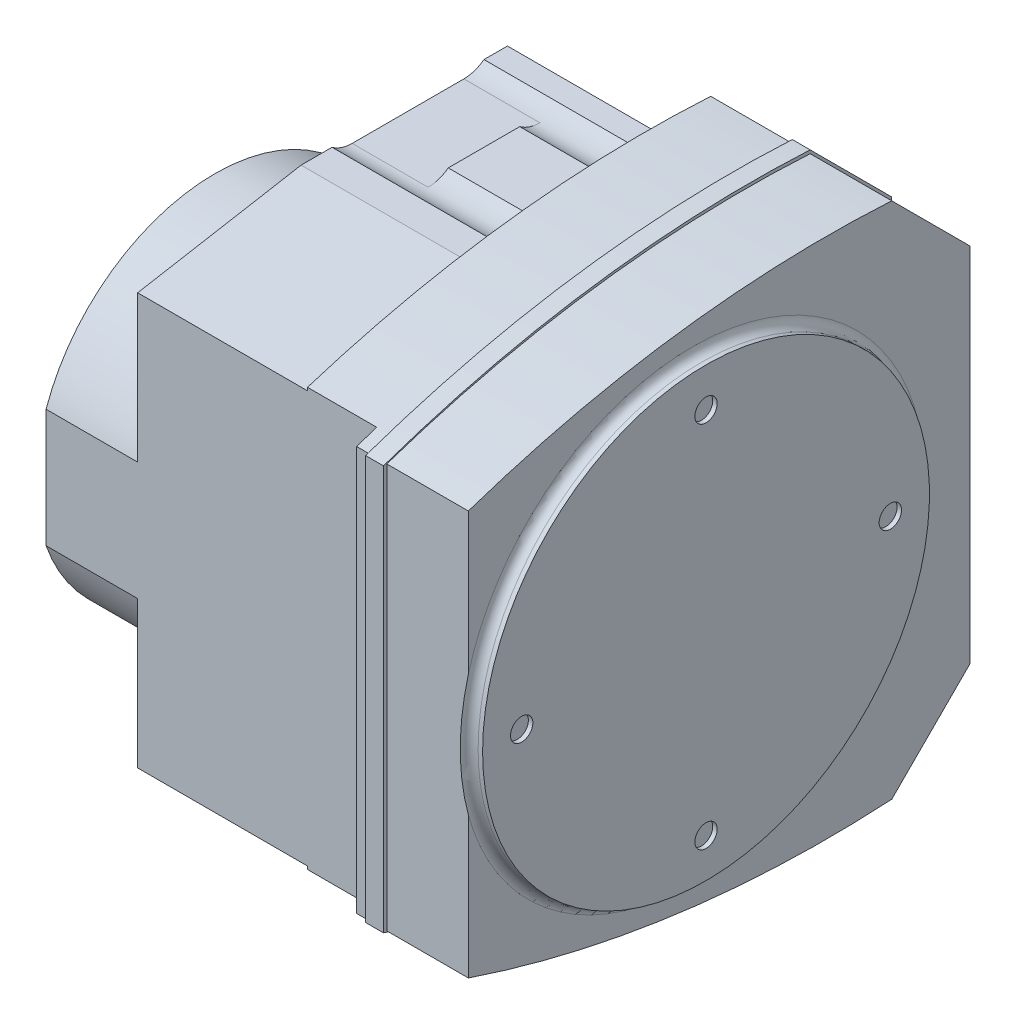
ISO-10303-21;
HEADER;
FILE_DESCRIPTION(('STEP AP214'),'2;1');
FILE_NAME('part.step','',(''),(''),'','','');
FILE_SCHEMA(('AUTOMOTIVE_DESIGN { 1 0 10303 214 1 1 1 1 }'));
ENDSEC;
DATA;
#1=APPLICATION_CONTEXT('core data for automotive mechanical design processes');
#2=APPLICATION_PROTOCOL_DEFINITION('international standard','automotive_design',2000,#1);
#3=PRODUCT_CONTEXT('',#1,'mechanical');
#4=PRODUCT('Part','Part','',(#3));
#5=PRODUCT_RELATED_PRODUCT_CATEGORY('part','',(#4));
#6=PRODUCT_DEFINITION_FORMATION('','',#4);
#7=PRODUCT_DEFINITION_CONTEXT('part definition',#1,'design');
#8=PRODUCT_DEFINITION('design','',#6,#7);
#9=PRODUCT_DEFINITION_SHAPE('','',#8);
#10=(LENGTH_UNIT() NAMED_UNIT(*) SI_UNIT(.MILLI.,.METRE.));
#11=(NAMED_UNIT(*) PLANE_ANGLE_UNIT() SI_UNIT($,.RADIAN.));
#12=(NAMED_UNIT(*) SI_UNIT($,.STERADIAN.) SOLID_ANGLE_UNIT());
#13=UNCERTAINTY_MEASURE_WITH_UNIT(LENGTH_MEASURE(1.E-05),#10,'distance_accuracy_value','');
#14=(GEOMETRIC_REPRESENTATION_CONTEXT(3) GLOBAL_UNCERTAINTY_ASSIGNED_CONTEXT((#13)) GLOBAL_UNIT_ASSIGNED_CONTEXT((#10,
#11,#12)) REPRESENTATION_CONTEXT('',''));
#15=CARTESIAN_POINT('',(0.,0.,0.));
#16=DIRECTION('',(0.,0.,1.));
#17=DIRECTION('',(1.,0.,0.));
#18=AXIS2_PLACEMENT_3D('',#15,#16,#17);
#19=CARTESIAN_POINT('',(257.,-46.1450000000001,-71.1450000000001));
#20=DIRECTION('',(-1.,0.,0.));
#21=DIRECTION('',(0.,0.,1.));
#22=AXIS2_PLACEMENT_3D('',#19,#20,#21);
#23=PLANE('',#22);
#24=CARTESIAN_POINT('',(257.,0.,-2.50667542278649E-13));
#25=DIRECTION('',(-1.,0.,0.));
#26=DIRECTION('',(0.,0.,1.));
#27=AXIS2_PLACEMENT_3D('',#24,#25,#26);
#28=CIRCLE('',#27,80.);
#29=CARTESIAN_POINT('',(257.,-15.020083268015,-78.5773319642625));
#30=VERTEX_POINT('',#29);
#31=CARTESIAN_POINT('',(257.,-65.623106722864,-45.7559598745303));
#32=VERTEX_POINT('',#31);
#33=EDGE_CURVE('E519',#30,#32,#28,.T.);
#34=ORIENTED_EDGE('',*,*,#33,.F.);
#35=CARTESIAN_POINT('',(257.,-46.1450000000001,-71.1450000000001));
#36=DIRECTION('',(-1.,0.,0.));
#37=DIRECTION('',(0.,0.,1.));
#38=AXIS2_PLACEMENT_3D('',#35,#36,#37);
#39=CIRCLE('',#38,32.);
#40=EDGE_CURVE('E335',#32,#30,#39,.F.);
#41=ORIENTED_EDGE('',*,*,#40,.F.);
#42=EDGE_LOOP('',(#34,#41));
#43=FACE_BOUND('',#42,.T.);
#44=ADVANCED_FACE('F16',(#43),#23,.T.);
#45=CARTESIAN_POINT('',(257.,21.8519999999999,-71.7560000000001));
#46=DIRECTION('',(-1.,0.,0.));
#47=DIRECTION('',(0.,0.,1.));
#48=AXIS2_PLACEMENT_3D('',#45,#46,#47);
#49=PLANE('',#48);
#50=CARTESIAN_POINT('',(257.,0.,-2.50667542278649E-13));
#51=DIRECTION('',(-1.,0.,0.));
#52=DIRECTION('',(0.,0.,1.));
#53=AXIS2_PLACEMENT_3D('',#50,#51,#52);
#54=CIRCLE('',#53,80.);
#55=CARTESIAN_POINT('',(257.,7.91112398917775,-79.6078772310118));
#56=VERTEX_POINT('',#55);
#57=CARTESIAN_POINT('',(257.,5.74608128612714,-79.7933740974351));
#58=VERTEX_POINT('',#57);
#59=EDGE_CURVE('E337',#56,#58,#54,.T.);
#60=ORIENTED_EDGE('',*,*,#59,.F.);
#61=CARTESIAN_POINT('',(257.,21.8519999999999,-71.7560000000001));
#62=DIRECTION('',(-1.,0.,0.));
#63=DIRECTION('',(0.,0.,1.));
#64=AXIS2_PLACEMENT_3D('',#61,#62,#63);
#65=CIRCLE('',#64,16.);
#66=CARTESIAN_POINT('',(257.,37.803006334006,-70.5048417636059));
#67=VERTEX_POINT('',#66);
#68=EDGE_CURVE('E20',#56,#67,#65,.T.);
#69=ORIENTED_EDGE('',*,*,#68,.T.);
#70=CARTESIAN_POINT('',(257.,0.,-2.50667542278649E-13));
#71=DIRECTION('',(-1.,0.,0.));
#72=DIRECTION('',(0.,0.,1.));
#73=AXIS2_PLACEMENT_3D('',#70,#71,#72);
#74=CIRCLE('',#73,80.);
#75=CARTESIAN_POINT('',(257.,39.7039499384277,-69.4521155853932));
#76=VERTEX_POINT('',#75);
#77=EDGE_CURVE('E512',#76,#67,#74,.T.);
#78=ORIENTED_EDGE('',*,*,#77,.F.);
#79=CARTESIAN_POINT('',(257.,21.8519999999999,-71.7560000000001));
#80=DIRECTION('',(-1.,0.,0.));
#81=DIRECTION('',(0.,0.,1.));
#82=AXIS2_PLACEMENT_3D('',#79,#80,#81);
#83=CIRCLE('',#82,18.);
#84=EDGE_CURVE('E339',#58,#76,#83,.F.);
#85=ORIENTED_EDGE('',*,*,#84,.F.);
#86=EDGE_LOOP('',(#60,#69,#78,#85));
#87=FACE_BOUND('',#86,.T.);
#88=ADVANCED_FACE('F338',(#87),#49,.T.);
#89=CARTESIAN_POINT('',(236.5,21.8519999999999,-71.7560000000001));
#90=DIRECTION('',(-1.,0.,0.));
#91=DIRECTION('',(0.,0.,1.));
#92=AXIS2_PLACEMENT_3D('',#89,#90,#91);
#93=CYLINDRICAL_SURFACE('',#92,16.);
#94=ORIENTED_EDGE('',*,*,#68,.F.);
#95=DIRECTION('',(-1.,0.,0.));
#96=VECTOR('',#95,1.);
#97=CARTESIAN_POINT('',(243.5,7.91112398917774,-79.6078772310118));
#98=LINE('',#97,#96);
#99=CARTESIAN_POINT('',(223.,7.91112398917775,-79.6078772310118));
#100=VERTEX_POINT('',#99);
#101=EDGE_CURVE('E328',#100,#56,#98,.F.);
#102=ORIENTED_EDGE('',*,*,#101,.F.);
#103=CARTESIAN_POINT('',(223.,21.852,-71.7560000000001));
#104=DIRECTION('',(-1.,0.,0.));
#105=DIRECTION('',(0.,0.,1.));
#106=AXIS2_PLACEMENT_3D('',#103,#104,#105);
#107=CIRCLE('',#106,16.);
#108=CARTESIAN_POINT('',(223.,37.803006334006,-70.5048417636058));
#109=VERTEX_POINT('',#108);
#110=EDGE_CURVE('E516',#109,#100,#107,.F.);
#111=ORIENTED_EDGE('',*,*,#110,.F.);
#112=DIRECTION('',(-1.,0.,0.));
#113=VECTOR('',#112,1.);
#114=CARTESIAN_POINT('',(243.5,37.8030063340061,-70.5048417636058));
#115=LINE('',#114,#113);
#116=EDGE_CURVE('E331',#67,#109,#115,.T.);
#117=ORIENTED_EDGE('',*,*,#116,.F.);
#118=EDGE_LOOP('',(#94,#102,#111,#117));
#119=FACE_BOUND('',#118,.T.);
#120=ADVANCED_FACE('F326',(#119),#93,.F.);
#121=CARTESIAN_POINT('',(260.5,-46.1450000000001,-71.145));
#122=DIRECTION('',(-1.,0.,0.));
#123=DIRECTION('',(0.,0.,1.));
#124=AXIS2_PLACEMENT_3D('',#121,#122,#123);
#125=CYLINDRICAL_SURFACE('',#124,32.);
#126=DIRECTION('',(-1.,0.,0.));
#127=VECTOR('',#126,1.);
#128=CARTESIAN_POINT('',(243.5,-15.0200832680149,-78.5773319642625));
#129=LINE('',#128,#127);
#130=CARTESIAN_POINT('',(264.,-15.020083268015,-78.5773319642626));
#131=VERTEX_POINT('',#130);
#132=EDGE_CURVE('E521',#131,#30,#129,.T.);
#133=ORIENTED_EDGE('',*,*,#132,.F.);
#134=CARTESIAN_POINT('',(264.,-46.1450000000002,-71.145));
#135=DIRECTION('',(-1.,0.,0.));
#136=DIRECTION('',(0.,0.,1.));
#137=AXIS2_PLACEMENT_3D('',#134,#135,#136);
#138=CIRCLE('',#137,32.);
#139=CARTESIAN_POINT('',(264.,-65.623106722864,-45.7559598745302));
#140=VERTEX_POINT('',#139);
#141=EDGE_CURVE('E506',#140,#131,#138,.F.);
#142=ORIENTED_EDGE('',*,*,#141,.F.);
#143=DIRECTION('',(-1.,0.,0.));
#144=VECTOR('',#143,1.);
#145=CARTESIAN_POINT('',(243.5,-65.623106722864,-45.7559598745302));
#146=LINE('',#145,#144);
#147=EDGE_CURVE('E518',#32,#140,#146,.F.);
#148=ORIENTED_EDGE('',*,*,#147,.F.);
#149=ORIENTED_EDGE('',*,*,#40,.T.);
#150=EDGE_LOOP('',(#133,#142,#148,#149));
#151=FACE_BOUND('',#150,.T.);
#152=ADVANCED_FACE('F526',(#151),#125,.T.);
#153=CARTESIAN_POINT('',(260.5,21.852,-71.7560000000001));
#154=DIRECTION('',(-1.,0.,0.));
#155=DIRECTION('',(0.,0.,1.));
#156=AXIS2_PLACEMENT_3D('',#153,#154,#155);
#157=CYLINDRICAL_SURFACE('',#156,18.);
#158=DIRECTION('',(-1.,0.,0.));
#159=VECTOR('',#158,1.);
#160=CARTESIAN_POINT('',(243.5,5.74608128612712,-79.793374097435));
#161=LINE('',#160,#159);
#162=CARTESIAN_POINT('',(264.,5.74608128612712,-79.7933740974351));
#163=VERTEX_POINT('',#162);
#164=EDGE_CURVE('E342',#58,#163,#161,.F.);
#165=ORIENTED_EDGE('',*,*,#164,.F.);
#166=ORIENTED_EDGE('',*,*,#84,.T.);
#167=DIRECTION('',(-1.,0.,0.));
#168=VECTOR('',#167,1.);
#169=CARTESIAN_POINT('',(243.5,39.7039499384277,-69.4521155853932));
#170=LINE('',#169,#168);
#171=CARTESIAN_POINT('',(264.,39.7039499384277,-69.4521155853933));
#172=VERTEX_POINT('',#171);
#173=EDGE_CURVE('E514',#172,#76,#170,.T.);
#174=ORIENTED_EDGE('',*,*,#173,.F.);
#175=CARTESIAN_POINT('',(264.,21.8519999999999,-71.7560000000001));
#176=DIRECTION('',(-1.,0.,0.));
#177=DIRECTION('',(0.,0.,1.));
#178=AXIS2_PLACEMENT_3D('',#175,#176,#177);
#179=CIRCLE('',#178,18.);
#180=EDGE_CURVE('E500',#163,#172,#179,.F.);
#181=ORIENTED_EDGE('',*,*,#180,.F.);
#182=EDGE_LOOP('',(#165,#166,#174,#181));
#183=FACE_BOUND('',#182,.T.);
#184=ADVANCED_FACE('F1214',(#183),#157,.T.);
#185=CARTESIAN_POINT('',(298.,-103.5,-45.5));
#186=DIRECTION('',(-1.,0.,0.));
#187=DIRECTION('',(0.,0.,1.));
#188=AXIS2_PLACEMENT_3D('',#185,#186,#187);
#189=PLANE('',#188);
#190=CARTESIAN_POINT('',(298.,-117.,-20.5000000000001));
#191=DIRECTION('',(-1.,0.,0.));
#192=DIRECTION('',(0.,0.,1.));
#193=AXIS2_PLACEMENT_3D('',#190,#191,#192);
#194=CIRCLE('',#193,15.);
#195=CARTESIAN_POINT('',(298.,-105.,-29.5000000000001));
#196=VERTEX_POINT('',#195);
#197=CARTESIAN_POINT('',(298.,-102.,-20.5000000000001));
#198=VERTEX_POINT('',#197);
#199=EDGE_CURVE('E484',#196,#198,#194,.F.);
#200=ORIENTED_EDGE('',*,*,#199,.T.);
#201=DIRECTION('',(0.,0.,-1.));
#202=VECTOR('',#201,1.);
#203=CARTESIAN_POINT('',(298.,-102.,-45.5));
#204=LINE('',#203,#202);
#205=CARTESIAN_POINT('',(298.,-102.,-70.5));
#206=VERTEX_POINT('',#205);
#207=EDGE_CURVE('E352',#206,#198,#204,.F.);
#208=ORIENTED_EDGE('',*,*,#207,.F.);
#209=CARTESIAN_POINT('',(298.,-117.,-70.5000000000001));
#210=DIRECTION('',(-1.,0.,0.));
#211=DIRECTION('',(0.,0.,1.));
#212=AXIS2_PLACEMENT_3D('',#209,#210,#211);
#213=CIRCLE('',#212,15.);
#214=CARTESIAN_POINT('',(298.,-105.,-61.5000000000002));
#215=VERTEX_POINT('',#214);
#216=EDGE_CURVE('E481',#206,#215,#213,.F.);
#217=ORIENTED_EDGE('',*,*,#216,.T.);
#218=DIRECTION('',(0.,0.,1.));
#219=VECTOR('',#218,1.);
#220=CARTESIAN_POINT('',(298.,-105.,-17.2500000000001));
#221=LINE('',#220,#219);
#222=EDGE_CURVE('E483',#215,#196,#221,.T.);
#223=ORIENTED_EDGE('',*,*,#222,.T.);
#224=EDGE_LOOP('',(#200,#208,#217,#223));
#225=FACE_BOUND('',#224,.T.);
#226=ADVANCED_FACE('F1208',(#225),#189,.T.);
#227=CARTESIAN_POINT('',(281.,-102.,-45.5));
#228=DIRECTION('',(0.,-1.,0.));
#229=DIRECTION('',(0.,0.,-1.));
#230=AXIS2_PLACEMENT_3D('',#227,#228,#229);
#231=PLANE('',#230);
#232=DIRECTION('',(-1.,0.,0.));
#233=VECTOR('',#232,1.);
#234=CARTESIAN_POINT('',(302.,-102.,-70.5000000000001));
#235=LINE('',#234,#233);
#236=CARTESIAN_POINT('',(264.,-102.,-70.5000000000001));
#237=VERTEX_POINT('',#236);
#238=EDGE_CURVE('E479',#237,#206,#235,.F.);
#239=ORIENTED_EDGE('',*,*,#238,.T.);
#240=ORIENTED_EDGE('',*,*,#207,.T.);
#241=DIRECTION('',(-1.,0.,0.));
#242=VECTOR('',#241,1.);
#243=CARTESIAN_POINT('',(302.,-102.,-20.5000000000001));
#244=LINE('',#243,#242);
#245=CARTESIAN_POINT('',(264.,-102.,-20.5000000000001));
#246=VERTEX_POINT('',#245);
#247=EDGE_CURVE('E486',#198,#246,#244,.T.);
#248=ORIENTED_EDGE('',*,*,#247,.T.);
#249=DIRECTION('',(0.,0.,1.));
#250=VECTOR('',#249,1.);
#251=CARTESIAN_POINT('',(264.,-102.,-17.25));
#252=LINE('',#251,#250);
#253=EDGE_CURVE('E495',#237,#246,#252,.T.);
#254=ORIENTED_EDGE('',*,*,#253,.F.);
#255=EDGE_LOOP('',(#239,#240,#248,#254));
#256=FACE_BOUND('',#255,.T.);
#257=ADVANCED_FACE('F1202',(#256),#231,.T.);
#258=CARTESIAN_POINT('',(298.,103.5,-45.5));
#259=DIRECTION('',(-1.,0.,0.));
#260=DIRECTION('',(0.,0.,1.));
#261=AXIS2_PLACEMENT_3D('',#258,#259,#260);
#262=PLANE('',#261);
#263=CARTESIAN_POINT('',(298.,117.,-20.5000000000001));
#264=DIRECTION('',(-1.,0.,0.));
#265=DIRECTION('',(0.,0.,1.));
#266=AXIS2_PLACEMENT_3D('',#263,#264,#265);
#267=CIRCLE('',#266,15.);
#268=CARTESIAN_POINT('',(298.,102.,-20.5));
#269=VERTEX_POINT('',#268);
#270=CARTESIAN_POINT('',(298.,105.,-29.5));
#271=VERTEX_POINT('',#270);
#272=EDGE_CURVE('E466',#269,#271,#267,.F.);
#273=ORIENTED_EDGE('',*,*,#272,.T.);
#274=DIRECTION('',(0.,0.,-1.));
#275=VECTOR('',#274,1.);
#276=CARTESIAN_POINT('',(298.,105.,-17.25));
#277=LINE('',#276,#275);
#278=CARTESIAN_POINT('',(298.,105.,-61.5));
#279=VERTEX_POINT('',#278);
#280=EDGE_CURVE('E468',#271,#279,#277,.T.);
#281=ORIENTED_EDGE('',*,*,#280,.T.);
#282=CARTESIAN_POINT('',(298.,117.,-70.5));
#283=DIRECTION('',(-1.,0.,0.));
#284=DIRECTION('',(0.,0.,1.));
#285=AXIS2_PLACEMENT_3D('',#282,#283,#284);
#286=CIRCLE('',#285,15.);
#287=CARTESIAN_POINT('',(298.,102.,-70.5));
#288=VERTEX_POINT('',#287);
#289=EDGE_CURVE('E469',#279,#288,#286,.F.);
#290=ORIENTED_EDGE('',*,*,#289,.T.);
#291=DIRECTION('',(0.,0.,1.));
#292=VECTOR('',#291,1.);
#293=CARTESIAN_POINT('',(298.,102.,-45.5));
#294=LINE('',#293,#292);
#295=EDGE_CURVE('E349',#269,#288,#294,.F.);
#296=ORIENTED_EDGE('',*,*,#295,.F.);
#297=EDGE_LOOP('',(#273,#281,#290,#296));
#298=FACE_BOUND('',#297,.T.);
#299=ADVANCED_FACE('F1196',(#298),#262,.T.);
#300=CARTESIAN_POINT('',(281.,102.,-45.5));
#301=DIRECTION('',(0.,1.,0.));
#302=DIRECTION('',(0.,0.,1.));
#303=AXIS2_PLACEMENT_3D('',#300,#301,#302);
#304=PLANE('',#303);
#305=DIRECTION('',(-1.,0.,0.));
#306=VECTOR('',#305,1.);
#307=CARTESIAN_POINT('',(302.,102.,-20.5));
#308=LINE('',#307,#306);
#309=CARTESIAN_POINT('',(264.,102.,-20.5000000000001));
#310=VERTEX_POINT('',#309);
#311=EDGE_CURVE('E464',#310,#269,#308,.F.);
#312=ORIENTED_EDGE('',*,*,#311,.T.);
#313=ORIENTED_EDGE('',*,*,#295,.T.);
#314=DIRECTION('',(-1.,0.,0.));
#315=VECTOR('',#314,1.);
#316=CARTESIAN_POINT('',(302.,102.,-70.5));
#317=LINE('',#316,#315);
#318=CARTESIAN_POINT('',(264.,102.,-70.5));
#319=VERTEX_POINT('',#318);
#320=EDGE_CURVE('E471',#288,#319,#317,.T.);
#321=ORIENTED_EDGE('',*,*,#320,.T.);
#322=DIRECTION('',(0.,0.,1.));
#323=VECTOR('',#322,1.);
#324=CARTESIAN_POINT('',(264.,102.,-17.25));
#325=LINE('',#324,#323);
#326=EDGE_CURVE('E499',#310,#319,#325,.F.);
#327=ORIENTED_EDGE('',*,*,#326,.F.);
#328=EDGE_LOOP('',(#312,#313,#321,#327));
#329=FACE_BOUND('',#328,.T.);
#330=ADVANCED_FACE('F1191',(#329),#304,.T.);
#331=CARTESIAN_POINT('',(243.5,0.,-2.43728648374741E-13));
#332=DIRECTION('',(-1.,0.,0.));
#333=DIRECTION('',(0.,0.,1.));
#334=AXIS2_PLACEMENT_3D('',#331,#332,#333);
#335=CYLINDRICAL_SURFACE('',#334,80.);
#336=ORIENTED_EDGE('',*,*,#147,.T.);
#337=CARTESIAN_POINT('',(264.,0.,0.));
#338=DIRECTION('',(-1.,0.,0.));
#339=DIRECTION('',(0.,0.,1.));
#340=AXIS2_PLACEMENT_3D('',#337,#338,#339);
#341=CIRCLE('',#340,80.);
#342=CARTESIAN_POINT('',(264.,-26.4527881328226,75.5));
#343=VERTEX_POINT('',#342);
#344=EDGE_CURVE('E491',#343,#140,#341,.F.);
#345=ORIENTED_EDGE('',*,*,#344,.F.);
#346=DIRECTION('',(-1.,0.,0.));
#347=VECTOR('',#346,1.);
#348=CARTESIAN_POINT('',(302.,-26.4527881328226,75.5));
#349=LINE('',#348,#347);
#350=CARTESIAN_POINT('',(223.,-26.4527881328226,75.4999999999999));
#351=VERTEX_POINT('',#350);
#352=EDGE_CURVE('E586',#343,#351,#349,.T.);
#353=ORIENTED_EDGE('',*,*,#352,.T.);
#354=CARTESIAN_POINT('',(223.,0.,-1.39645239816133E-13));
#355=DIRECTION('',(-1.,0.,0.));
#356=DIRECTION('',(0.,0.,1.));
#357=AXIS2_PLACEMENT_3D('',#354,#355,#356);
#358=CIRCLE('',#357,80.);
#359=EDGE_CURVE('E347',#100,#351,#358,.T.);
#360=ORIENTED_EDGE('',*,*,#359,.F.);
#361=ORIENTED_EDGE('',*,*,#101,.T.);
#362=ORIENTED_EDGE('',*,*,#59,.T.);
#363=ORIENTED_EDGE('',*,*,#164,.T.);
#364=CARTESIAN_POINT('',(264.,0.,0.));
#365=DIRECTION('',(-1.,0.,0.));
#366=DIRECTION('',(0.,0.,1.));
#367=AXIS2_PLACEMENT_3D('',#364,#365,#366);
#368=CIRCLE('',#367,80.);
#369=EDGE_CURVE('E503',#131,#163,#368,.F.);
#370=ORIENTED_EDGE('',*,*,#369,.F.);
#371=ORIENTED_EDGE('',*,*,#132,.T.);
#372=ORIENTED_EDGE('',*,*,#33,.T.);
#373=EDGE_LOOP('',(#336,#345,#353,#360,#361,#362,#363,#370,#371,#372));
#374=FACE_BOUND('',#373,.T.);
#375=ADVANCED_FACE('F345',(#374),#335,.T.);
#376=CARTESIAN_POINT('',(223.,0.,-1.39645239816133E-13));
#377=DIRECTION('',(-1.,0.,0.));
#378=DIRECTION('',(0.,0.,1.));
#379=AXIS2_PLACEMENT_3D('',#376,#377,#378);
#380=PLANE('',#379);
#381=ORIENTED_EDGE('',*,*,#110,.T.);
#382=ORIENTED_EDGE('',*,*,#359,.T.);
#383=DIRECTION('',(0.,1.,0.));
#384=VECTOR('',#383,1.);
#385=CARTESIAN_POINT('',(223.,0.,75.4999999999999));
#386=LINE('',#385,#384);
#387=CARTESIAN_POINT('',(223.,26.4527881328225,75.5));
#388=VERTEX_POINT('',#387);
#389=EDGE_CURVE('E588',#351,#388,#386,.T.);
#390=ORIENTED_EDGE('',*,*,#389,.T.);
#391=CARTESIAN_POINT('',(223.,0.,-1.39645239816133E-13));
#392=DIRECTION('',(-1.,0.,0.));
#393=DIRECTION('',(0.,0.,1.));
#394=AXIS2_PLACEMENT_3D('',#391,#392,#393);
#395=CIRCLE('',#394,80.);
#396=EDGE_CURVE('E509',#109,#388,#395,.F.);
#397=ORIENTED_EDGE('',*,*,#396,.F.);
#398=EDGE_LOOP('',(#381,#382,#390,#397));
#399=FACE_BOUND('',#398,.T.);
#400=ADVANCED_FACE('F1180',(#399),#380,.T.);
#401=CARTESIAN_POINT('',(243.5,0.,-2.43728648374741E-13));
#402=DIRECTION('',(-1.,0.,0.));
#403=DIRECTION('',(0.,0.,1.));
#404=AXIS2_PLACEMENT_3D('',#401,#402,#403);
#405=CYLINDRICAL_SURFACE('',#404,80.);
#406=ORIENTED_EDGE('',*,*,#116,.T.);
#407=ORIENTED_EDGE('',*,*,#396,.T.);
#408=DIRECTION('',(-1.,0.,0.));
#409=VECTOR('',#408,1.);
#410=CARTESIAN_POINT('',(302.,26.4527881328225,75.5));
#411=LINE('',#410,#409);
#412=CARTESIAN_POINT('',(264.,26.4527881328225,75.5));
#413=VERTEX_POINT('',#412);
#414=EDGE_CURVE('E591',#388,#413,#411,.F.);
#415=ORIENTED_EDGE('',*,*,#414,.T.);
#416=CARTESIAN_POINT('',(264.,0.,0.));
#417=DIRECTION('',(-1.,0.,0.));
#418=DIRECTION('',(0.,0.,1.));
#419=AXIS2_PLACEMENT_3D('',#416,#417,#418);
#420=CIRCLE('',#419,80.);
#421=EDGE_CURVE('E496',#172,#413,#420,.F.);
#422=ORIENTED_EDGE('',*,*,#421,.F.);
#423=ORIENTED_EDGE('',*,*,#173,.T.);
#424=ORIENTED_EDGE('',*,*,#77,.T.);
#425=EDGE_LOOP('',(#406,#407,#415,#422,#423,#424));
#426=FACE_BOUND('',#425,.T.);
#427=ADVANCED_FACE('F1174',(#426),#405,.T.);
#428=CARTESIAN_POINT('',(264.,-1.51788304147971E-13,-17.2500000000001));
#429=DIRECTION('',(-1.,0.,0.));
#430=DIRECTION('',(0.,0.,1.));
#431=AXIS2_PLACEMENT_3D('',#428,#429,#430);
#432=PLANE('',#431);
#433=DIRECTION('',(0.,1.,0.));
#434=VECTOR('',#433,1.);
#435=CARTESIAN_POINT('',(264.,0.,75.4999999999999));
#436=LINE('',#435,#434);
#437=CARTESIAN_POINT('',(264.,-92.0976124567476,75.5));
#438=VERTEX_POINT('',#437);
#439=EDGE_CURVE('E589',#438,#343,#436,.T.);
#440=ORIENTED_EDGE('',*,*,#439,.T.);
#441=ORIENTED_EDGE('',*,*,#344,.T.);
#442=ORIENTED_EDGE('',*,*,#141,.T.);
#443=ORIENTED_EDGE('',*,*,#369,.T.);
#444=ORIENTED_EDGE('',*,*,#180,.T.);
#445=ORIENTED_EDGE('',*,*,#421,.T.);
#446=DIRECTION('',(0.,1.,0.));
#447=VECTOR('',#446,1.);
#448=CARTESIAN_POINT('',(264.,0.,75.4999999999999));
#449=LINE('',#448,#447);
#450=CARTESIAN_POINT('',(264.,92.0976124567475,75.5));
#451=VERTEX_POINT('',#450);
#452=EDGE_CURVE('E593',#413,#451,#449,.T.);
#453=ORIENTED_EDGE('',*,*,#452,.T.);
#454=DIRECTION('',(0.,-0.173719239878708,0.984795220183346));
#455=VECTOR('',#454,1.);
#456=CARTESIAN_POINT('',(264.,103.255,12.2499999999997));
#457=LINE('',#456,#455);
#458=CARTESIAN_POINT('',(264.,105.,2.35778736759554));
#459=VERTEX_POINT('',#458);
#460=EDGE_CURVE('E600',#459,#451,#457,.T.);
#461=ORIENTED_EDGE('',*,*,#460,.F.);
#462=DIRECTION('',(0.,0.,-1.));
#463=VECTOR('',#462,1.);
#464=CARTESIAN_POINT('',(264.,105.,-17.2500000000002));
#465=LINE('',#464,#463);
#466=CARTESIAN_POINT('',(264.,105.,-11.5000000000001));
#467=VERTEX_POINT('',#466);
#468=EDGE_CURVE('E581',#459,#467,#465,.T.);
#469=ORIENTED_EDGE('',*,*,#468,.T.);
#470=CARTESIAN_POINT('',(264.,117.,-20.5));
#471=DIRECTION('',(-1.,0.,0.));
#472=DIRECTION('',(0.,0.,1.));
#473=AXIS2_PLACEMENT_3D('',#470,#471,#472);
#474=CIRCLE('',#473,15.);
#475=EDGE_CURVE('E461',#467,#310,#474,.F.);
#476=ORIENTED_EDGE('',*,*,#475,.T.);
#477=ORIENTED_EDGE('',*,*,#326,.T.);
#478=CARTESIAN_POINT('',(264.,117.,-70.5000000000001));
#479=DIRECTION('',(-1.,0.,0.));
#480=DIRECTION('',(0.,0.,1.));
#481=AXIS2_PLACEMENT_3D('',#478,#479,#480);
#482=CIRCLE('',#481,15.);
#483=CARTESIAN_POINT('',(264.,105.,-79.5));
#484=VERTEX_POINT('',#483);
#485=EDGE_CURVE('E473',#319,#484,#482,.F.);
#486=ORIENTED_EDGE('',*,*,#485,.T.);
#487=DIRECTION('',(0.,0.,-1.));
#488=VECTOR('',#487,1.);
#489=CARTESIAN_POINT('',(264.,105.,-17.2500000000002));
#490=LINE('',#489,#488);
#491=CARTESIAN_POINT('',(264.,105.,-90.0000000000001));
#492=VERTEX_POINT('',#491);
#493=EDGE_CURVE('E569',#484,#492,#490,.T.);
#494=ORIENTED_EDGE('',*,*,#493,.T.);
#495=DIRECTION('',(0.,0.707106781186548,0.707106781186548));
#496=VECTOR('',#495,1.);
#497=CARTESIAN_POINT('',(263.999999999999,113.284271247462,-81.7157287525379));
#498=LINE('',#497,#496);
#499=CARTESIAN_POINT('',(263.999999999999,85.,-110.));
#500=VERTEX_POINT('',#499);
#501=EDGE_CURVE('E566',#500,#492,#498,.T.);
#502=ORIENTED_EDGE('',*,*,#501,.F.);
#503=DIRECTION('',(0.,1.,0.));
#504=VECTOR('',#503,1.);
#505=CARTESIAN_POINT('',(263.999999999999,0.,-110.));
#506=LINE('',#505,#504);
#507=CARTESIAN_POINT('',(263.999999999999,-85.,-110.));
#508=VERTEX_POINT('',#507);
#509=EDGE_CURVE('E558',#500,#508,#506,.F.);
#510=ORIENTED_EDGE('',*,*,#509,.T.);
#511=DIRECTION('',(0.,0.707106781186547,-0.707106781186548));
#512=VECTOR('',#511,1.);
#513=CARTESIAN_POINT('',(263.999999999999,-113.284271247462,-81.7157287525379));
#514=LINE('',#513,#512);
#515=CARTESIAN_POINT('',(263.999999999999,-105.,-90.0000000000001));
#516=VERTEX_POINT('',#515);
#517=EDGE_CURVE('E555',#516,#508,#514,.T.);
#518=ORIENTED_EDGE('',*,*,#517,.F.);
#519=DIRECTION('',(0.,0.,1.));
#520=VECTOR('',#519,1.);
#521=CARTESIAN_POINT('',(263.999999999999,-105.,-17.2500000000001));
#522=LINE('',#521,#520);
#523=CARTESIAN_POINT('',(264.,-105.,-79.5000000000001));
#524=VERTEX_POINT('',#523);
#525=EDGE_CURVE('E548',#516,#524,#522,.T.);
#526=ORIENTED_EDGE('',*,*,#525,.T.);
#527=CARTESIAN_POINT('',(264.,-117.,-70.5000000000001));
#528=DIRECTION('',(-1.,0.,0.));
#529=DIRECTION('',(0.,0.,1.));
#530=AXIS2_PLACEMENT_3D('',#527,#528,#529);
#531=CIRCLE('',#530,15.);
#532=EDGE_CURVE('E476',#524,#237,#531,.F.);
#533=ORIENTED_EDGE('',*,*,#532,.T.);
#534=ORIENTED_EDGE('',*,*,#253,.T.);
#535=CARTESIAN_POINT('',(264.,-117.,-20.5000000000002));
#536=DIRECTION('',(-1.,0.,0.));
#537=DIRECTION('',(0.,0.,1.));
#538=AXIS2_PLACEMENT_3D('',#535,#536,#537);
#539=CIRCLE('',#538,15.);
#540=CARTESIAN_POINT('',(264.,-105.,-11.5000000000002));
#541=VERTEX_POINT('',#540);
#542=EDGE_CURVE('E488',#246,#541,#539,.F.);
#543=ORIENTED_EDGE('',*,*,#542,.T.);
#544=DIRECTION('',(0.,0.,1.));
#545=VECTOR('',#544,1.);
#546=CARTESIAN_POINT('',(264.,-105.,-17.2500000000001));
#547=LINE('',#546,#545);
#548=CARTESIAN_POINT('',(264.,-105.,2.3577873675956));
#549=VERTEX_POINT('',#548);
#550=EDGE_CURVE('E537',#541,#549,#547,.T.);
#551=ORIENTED_EDGE('',*,*,#550,.T.);
#552=DIRECTION('',(0.,-0.173719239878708,-0.984795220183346));
#553=VECTOR('',#552,1.);
#554=CARTESIAN_POINT('',(264.,-103.255,12.2499999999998));
#555=LINE('',#554,#553);
#556=EDGE_CURVE('E494',#438,#549,#555,.T.);
#557=ORIENTED_EDGE('',*,*,#556,.F.);
#558=EDGE_LOOP('',(#440,#441,#442,#443,#444,#445,#453,#461,#469,#476,#477,#486,#494,#502,#510,
#518,#526,#533,#534,#543,#551,#557));
#559=FACE_BOUND('',#558,.T.);
#560=ADVANCED_FACE('F1168',(#559),#432,.T.);
#561=CARTESIAN_POINT('',(302.,-103.255,12.2499999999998));
#562=DIRECTION('',(0.,-0.984795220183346,0.173719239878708));
#563=DIRECTION('',(0.,-0.173719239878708,-0.984795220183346));
#564=AXIS2_PLACEMENT_3D('',#561,#562,#563);
#565=PLANE('',#564);
#566=DIRECTION('',(-1.,0.,0.));
#567=VECTOR('',#566,1.);
#568=CARTESIAN_POINT('',(302.,-92.0976124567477,75.5));
#569=LINE('',#568,#567);
#570=CARTESIAN_POINT('',(340.,-92.0976124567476,75.5));
#571=VERTEX_POINT('',#570);
#572=EDGE_CURVE('E614',#571,#438,#569,.T.);
#573=ORIENTED_EDGE('',*,*,#572,.T.);
#574=ORIENTED_EDGE('',*,*,#556,.T.);
#575=DIRECTION('',(1.,0.,0.));
#576=VECTOR('',#575,1.);
#577=CARTESIAN_POINT('',(302.,-105.,2.35778736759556));
#578=LINE('',#577,#576);
#579=CARTESIAN_POINT('',(340.,-105.,2.35778736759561));
#580=VERTEX_POINT('',#579);
#581=EDGE_CURVE('E490',#549,#580,#578,.T.);
#582=ORIENTED_EDGE('',*,*,#581,.T.);
#583=DIRECTION('',(0.,-0.173719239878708,-0.984795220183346));
#584=VECTOR('',#583,1.);
#585=CARTESIAN_POINT('',(340.,-92.0976124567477,75.5));
#586=LINE('',#585,#584);
#587=EDGE_CURVE('E621',#571,#580,#586,.T.);
#588=ORIENTED_EDGE('',*,*,#587,.F.);
#589=EDGE_LOOP('',(#573,#574,#582,#588));
#590=FACE_BOUND('',#589,.T.);
#591=ADVANCED_FACE('F1162',(#590),#565,.T.);
#592=CARTESIAN_POINT('',(302.,-105.,-17.2500000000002));
#593=DIRECTION('',(0.,1.,0.));
#594=DIRECTION('',(0.,0.,1.));
#595=AXIS2_PLACEMENT_3D('',#592,#593,#594);
#596=PLANE('',#595);
#597=ORIENTED_EDGE('',*,*,#550,.F.);
#598=DIRECTION('',(-1.,0.,0.));
#599=VECTOR('',#598,1.);
#600=CARTESIAN_POINT('',(302.,-105.,-11.5000000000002));
#601=LINE('',#600,#599);
#602=CARTESIAN_POINT('',(340.,-105.,-11.5000000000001));
#603=VERTEX_POINT('',#602);
#604=EDGE_CURVE('E487',#541,#603,#601,.F.);
#605=ORIENTED_EDGE('',*,*,#604,.T.);
#606=DIRECTION('',(0.,0.,1.));
#607=VECTOR('',#606,1.);
#608=CARTESIAN_POINT('',(340.,-105.,-28.0249426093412));
#609=LINE('',#608,#607);
#610=EDGE_CURVE('E460',#580,#603,#609,.F.);
#611=ORIENTED_EDGE('',*,*,#610,.F.);
#612=ORIENTED_EDGE('',*,*,#581,.F.);
#613=EDGE_LOOP('',(#597,#605,#611,#612));
#614=FACE_BOUND('',#613,.T.);
#615=ADVANCED_FACE('F1156',(#614),#596,.F.);
#616=CARTESIAN_POINT('',(302.,-117.,-20.5000000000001));
#617=DIRECTION('',(-1.,0.,0.));
#618=DIRECTION('',(0.,0.,1.));
#619=AXIS2_PLACEMENT_3D('',#616,#617,#618);
#620=CYLINDRICAL_SURFACE('',#619,15.);
#621=ORIENTED_EDGE('',*,*,#199,.F.);
#622=DIRECTION('',(1.,0.,0.));
#623=VECTOR('',#622,1.);
#624=CARTESIAN_POINT('',(302.,-105.,-29.5000000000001));
#625=LINE('',#624,#623);
#626=CARTESIAN_POINT('',(340.,-105.,-29.5000000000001));
#627=VERTEX_POINT('',#626);
#628=EDGE_CURVE('E541',#196,#627,#625,.T.);
#629=ORIENTED_EDGE('',*,*,#628,.T.);
#630=CARTESIAN_POINT('',(340.,-117.,-20.5000000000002));
#631=DIRECTION('',(-1.,0.,0.));
#632=DIRECTION('',(0.,0.,1.));
#633=AXIS2_PLACEMENT_3D('',#630,#631,#632);
#634=CIRCLE('',#633,15.);
#635=EDGE_CURVE('E457',#603,#627,#634,.T.);
#636=ORIENTED_EDGE('',*,*,#635,.F.);
#637=ORIENTED_EDGE('',*,*,#604,.F.);
#638=ORIENTED_EDGE('',*,*,#542,.F.);
#639=ORIENTED_EDGE('',*,*,#247,.F.);
#640=EDGE_LOOP('',(#621,#629,#636,#637,#638,#639));
#641=FACE_BOUND('',#640,.T.);
#642=ADVANCED_FACE('F1150',(#641),#620,.F.);
#643=CARTESIAN_POINT('',(302.,-105.,-17.2500000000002));
#644=DIRECTION('',(0.,1.,0.));
#645=DIRECTION('',(0.,0.,1.));
#646=AXIS2_PLACEMENT_3D('',#643,#644,#645);
#647=PLANE('',#646);
#648=DIRECTION('',(-1.,0.,0.));
#649=VECTOR('',#648,1.);
#650=CARTESIAN_POINT('',(302.,-105.,-61.5000000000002));
#651=LINE('',#650,#649);
#652=CARTESIAN_POINT('',(340.,-105.,-61.5000000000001));
#653=VERTEX_POINT('',#652);
#654=EDGE_CURVE('E480',#215,#653,#651,.F.);
#655=ORIENTED_EDGE('',*,*,#654,.T.);
#656=DIRECTION('',(0.,0.,1.));
#657=VECTOR('',#656,1.);
#658=CARTESIAN_POINT('',(340.,-105.,-28.0249426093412));
#659=LINE('',#658,#657);
#660=EDGE_CURVE('E456',#627,#653,#659,.F.);
#661=ORIENTED_EDGE('',*,*,#660,.F.);
#662=ORIENTED_EDGE('',*,*,#628,.F.);
#663=ORIENTED_EDGE('',*,*,#222,.F.);
#664=EDGE_LOOP('',(#655,#661,#662,#663));
#665=FACE_BOUND('',#664,.T.);
#666=ADVANCED_FACE('F1144',(#665),#647,.F.);
#667=CARTESIAN_POINT('',(302.,-117.,-70.5000000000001));
#668=DIRECTION('',(-1.,0.,0.));
#669=DIRECTION('',(0.,0.,1.));
#670=AXIS2_PLACEMENT_3D('',#667,#668,#669);
#671=CYLINDRICAL_SURFACE('',#670,15.);
#672=ORIENTED_EDGE('',*,*,#532,.F.);
#673=DIRECTION('',(1.,0.,0.));
#674=VECTOR('',#673,1.);
#675=CARTESIAN_POINT('',(302.,-105.,-79.5000000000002));
#676=LINE('',#675,#674);
#677=CARTESIAN_POINT('',(340.,-105.,-79.5000000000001));
#678=VERTEX_POINT('',#677);
#679=EDGE_CURVE('E552',#524,#678,#676,.T.);
#680=ORIENTED_EDGE('',*,*,#679,.T.);
#681=CARTESIAN_POINT('',(340.,-117.,-70.5));
#682=DIRECTION('',(-1.,0.,0.));
#683=DIRECTION('',(0.,0.,1.));
#684=AXIS2_PLACEMENT_3D('',#681,#682,#683);
#685=CIRCLE('',#684,15.);
#686=EDGE_CURVE('E452',#653,#678,#685,.T.);
#687=ORIENTED_EDGE('',*,*,#686,.F.);
#688=ORIENTED_EDGE('',*,*,#654,.F.);
#689=ORIENTED_EDGE('',*,*,#216,.F.);
#690=ORIENTED_EDGE('',*,*,#238,.F.);
#691=EDGE_LOOP('',(#672,#680,#687,#688,#689,#690));
#692=FACE_BOUND('',#691,.T.);
#693=ADVANCED_FACE('F1138',(#692),#671,.F.);
#694=CARTESIAN_POINT('',(302.,-105.,-17.2500000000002));
#695=DIRECTION('',(0.,1.,0.));
#696=DIRECTION('',(0.,0.,1.));
#697=AXIS2_PLACEMENT_3D('',#694,#695,#696);
#698=PLANE('',#697);
#699=ORIENTED_EDGE('',*,*,#525,.F.);
#700=DIRECTION('',(1.,0.,0.));
#701=VECTOR('',#700,1.);
#702=CARTESIAN_POINT('',(302.,-105.,-90.));
#703=LINE('',#702,#701);
#704=CARTESIAN_POINT('',(340.,-105.,-90.));
#705=VERTEX_POINT('',#704);
#706=EDGE_CURVE('E559',#705,#516,#703,.F.);
#707=ORIENTED_EDGE('',*,*,#706,.F.);
#708=DIRECTION('',(0.,0.,1.));
#709=VECTOR('',#708,1.);
#710=CARTESIAN_POINT('',(340.,-105.,-28.0249426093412));
#711=LINE('',#710,#709);
#712=EDGE_CURVE('E455',#678,#705,#711,.F.);
#713=ORIENTED_EDGE('',*,*,#712,.F.);
#714=ORIENTED_EDGE('',*,*,#679,.F.);
#715=EDGE_LOOP('',(#699,#707,#713,#714));
#716=FACE_BOUND('',#715,.T.);
#717=ADVANCED_FACE('F1132',(#716),#698,.F.);
#718=CARTESIAN_POINT('',(302.,-113.284271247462,-81.7157287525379));
#719=DIRECTION('',(0.,-0.707106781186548,-0.707106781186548));
#720=DIRECTION('',(0.,0.707106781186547,-0.707106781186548));
#721=AXIS2_PLACEMENT_3D('',#718,#719,#720);
#722=PLANE('',#721);
#723=DIRECTION('',(1.,0.,0.));
#724=VECTOR('',#723,1.);
#725=CARTESIAN_POINT('',(302.,-85.0000000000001,-110.));
#726=LINE('',#725,#724);
#727=CARTESIAN_POINT('',(340.,-85.0000000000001,-110.));
#728=VERTEX_POINT('',#727);
#729=EDGE_CURVE('E563',#508,#728,#726,.T.);
#730=ORIENTED_EDGE('',*,*,#729,.T.);
#731=DIRECTION('',(0.,0.707106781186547,-0.707106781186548));
#732=VECTOR('',#731,1.);
#733=CARTESIAN_POINT('',(340.,-105.,-90.));
#734=LINE('',#733,#732);
#735=EDGE_CURVE('E637',#705,#728,#734,.T.);
#736=ORIENTED_EDGE('',*,*,#735,.F.);
#737=ORIENTED_EDGE('',*,*,#706,.T.);
#738=ORIENTED_EDGE('',*,*,#517,.T.);
#739=EDGE_LOOP('',(#730,#736,#737,#738));
#740=FACE_BOUND('',#739,.T.);
#741=ADVANCED_FACE('F1126',(#740),#722,.T.);
#742=CARTESIAN_POINT('',(302.,0.,-110.));
#743=DIRECTION('',(0.,0.,1.));
#744=DIRECTION('',(1.,0.,0.));
#745=AXIS2_PLACEMENT_3D('',#742,#743,#744);
#746=PLANE('',#745);
#747=DIRECTION('',(0.,1.,0.));
#748=VECTOR('',#747,1.);
#749=CARTESIAN_POINT('',(340.,-2.90566182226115E-13,-110.));
#750=LINE('',#749,#748);
#751=CARTESIAN_POINT('',(340.,85.,-110.));
#752=VERTEX_POINT('',#751);
#753=EDGE_CURVE('E640',#728,#752,#750,.T.);
#754=ORIENTED_EDGE('',*,*,#753,.F.);
#755=ORIENTED_EDGE('',*,*,#729,.F.);
#756=ORIENTED_EDGE('',*,*,#509,.F.);
#757=DIRECTION('',(1.,0.,0.));
#758=VECTOR('',#757,1.);
#759=CARTESIAN_POINT('',(302.,84.9999999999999,-110.));
#760=LINE('',#759,#758);
#761=EDGE_CURVE('E570',#752,#500,#760,.F.);
#762=ORIENTED_EDGE('',*,*,#761,.F.);
#763=EDGE_LOOP('',(#754,#755,#756,#762));
#764=FACE_BOUND('',#763,.T.);
#765=ADVANCED_FACE('F1120',(#764),#746,.F.);
#766=CARTESIAN_POINT('',(302.,113.284271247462,-81.7157287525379));
#767=DIRECTION('',(0.,0.707106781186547,-0.707106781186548));
#768=DIRECTION('',(0.,0.707106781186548,0.707106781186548));
#769=AXIS2_PLACEMENT_3D('',#766,#767,#768);
#770=PLANE('',#769);
#771=ORIENTED_EDGE('',*,*,#761,.T.);
#772=ORIENTED_EDGE('',*,*,#501,.T.);
#773=DIRECTION('',(1.,0.,0.));
#774=VECTOR('',#773,1.);
#775=CARTESIAN_POINT('',(302.,105.,-90.0000000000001));
#776=LINE('',#775,#774);
#777=CARTESIAN_POINT('',(340.,105.,-90.0000000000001));
#778=VERTEX_POINT('',#777);
#779=EDGE_CURVE('E475',#492,#778,#776,.T.);
#780=ORIENTED_EDGE('',*,*,#779,.T.);
#781=DIRECTION('',(0.,0.707106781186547,0.707106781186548));
#782=VECTOR('',#781,1.);
#783=CARTESIAN_POINT('',(340.,85.,-110.));
#784=LINE('',#783,#782);
#785=EDGE_CURVE('E648',#752,#778,#784,.T.);
#786=ORIENTED_EDGE('',*,*,#785,.F.);
#787=EDGE_LOOP('',(#771,#772,#780,#786));
#788=FACE_BOUND('',#787,.T.);
#789=ADVANCED_FACE('F1114',(#788),#770,.T.);
#790=CARTESIAN_POINT('',(302.,105.,-17.25));
#791=DIRECTION('',(0.,-1.,0.));
#792=DIRECTION('',(0.,0.,-1.));
#793=AXIS2_PLACEMENT_3D('',#790,#791,#792);
#794=PLANE('',#793);
#795=DIRECTION('',(0.,0.,1.));
#796=VECTOR('',#795,1.);
#797=CARTESIAN_POINT('',(340.,105.,-28.0249426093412));
#798=LINE('',#797,#796);
#799=CARTESIAN_POINT('',(340.,105.,-79.5000000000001));
#800=VERTEX_POINT('',#799);
#801=EDGE_CURVE('E451',#778,#800,#798,.T.);
#802=ORIENTED_EDGE('',*,*,#801,.F.);
#803=ORIENTED_EDGE('',*,*,#779,.F.);
#804=ORIENTED_EDGE('',*,*,#493,.F.);
#805=DIRECTION('',(-1.,0.,0.));
#806=VECTOR('',#805,1.);
#807=CARTESIAN_POINT('',(302.,105.,-79.5000000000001));
#808=LINE('',#807,#806);
#809=EDGE_CURVE('E472',#484,#800,#808,.F.);
#810=ORIENTED_EDGE('',*,*,#809,.T.);
#811=EDGE_LOOP('',(#802,#803,#804,#810));
#812=FACE_BOUND('',#811,.T.);
#813=ADVANCED_FACE('F1108',(#812),#794,.F.);
#814=CARTESIAN_POINT('',(302.,117.,-70.5000000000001));
#815=DIRECTION('',(-1.,0.,0.));
#816=DIRECTION('',(0.,0.,1.));
#817=AXIS2_PLACEMENT_3D('',#814,#815,#816);
#818=CYLINDRICAL_SURFACE('',#817,15.);
#819=ORIENTED_EDGE('',*,*,#289,.F.);
#820=DIRECTION('',(1.,0.,0.));
#821=VECTOR('',#820,1.);
#822=CARTESIAN_POINT('',(302.,105.,-61.5000000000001));
#823=LINE('',#822,#821);
#824=CARTESIAN_POINT('',(340.,105.,-61.5));
#825=VERTEX_POINT('',#824);
#826=EDGE_CURVE('E575',#279,#825,#823,.T.);
#827=ORIENTED_EDGE('',*,*,#826,.T.);
#828=CARTESIAN_POINT('',(340.,117.,-70.5));
#829=DIRECTION('',(-1.,0.,0.));
#830=DIRECTION('',(0.,0.,1.));
#831=AXIS2_PLACEMENT_3D('',#828,#829,#830);
#832=CIRCLE('',#831,15.);
#833=EDGE_CURVE('E448',#800,#825,#832,.T.);
#834=ORIENTED_EDGE('',*,*,#833,.F.);
#835=ORIENTED_EDGE('',*,*,#809,.F.);
#836=ORIENTED_EDGE('',*,*,#485,.F.);
#837=ORIENTED_EDGE('',*,*,#320,.F.);
#838=EDGE_LOOP('',(#819,#827,#834,#835,#836,#837));
#839=FACE_BOUND('',#838,.T.);
#840=ADVANCED_FACE('F1102',(#839),#818,.F.);
#841=CARTESIAN_POINT('',(302.,105.,-17.25));
#842=DIRECTION('',(0.,-1.,0.));
#843=DIRECTION('',(0.,0.,-1.));
#844=AXIS2_PLACEMENT_3D('',#841,#842,#843);
#845=PLANE('',#844);
#846=DIRECTION('',(-1.,0.,0.));
#847=VECTOR('',#846,1.);
#848=CARTESIAN_POINT('',(302.,105.,-29.5000000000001));
#849=LINE('',#848,#847);
#850=CARTESIAN_POINT('',(340.,105.,-29.5));
#851=VERTEX_POINT('',#850);
#852=EDGE_CURVE('E465',#271,#851,#849,.F.);
#853=ORIENTED_EDGE('',*,*,#852,.T.);
#854=DIRECTION('',(0.,0.,1.));
#855=VECTOR('',#854,1.);
#856=CARTESIAN_POINT('',(340.,105.,-28.0249426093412));
#857=LINE('',#856,#855);
#858=EDGE_CURVE('E447',#825,#851,#857,.T.);
#859=ORIENTED_EDGE('',*,*,#858,.F.);
#860=ORIENTED_EDGE('',*,*,#826,.F.);
#861=ORIENTED_EDGE('',*,*,#280,.F.);
#862=EDGE_LOOP('',(#853,#859,#860,#861));
#863=FACE_BOUND('',#862,.T.);
#864=ADVANCED_FACE('F1096',(#863),#845,.F.);
#865=CARTESIAN_POINT('',(302.,117.,-20.5));
#866=DIRECTION('',(-1.,0.,0.));
#867=DIRECTION('',(0.,0.,1.));
#868=AXIS2_PLACEMENT_3D('',#865,#866,#867);
#869=CYLINDRICAL_SURFACE('',#868,15.);
#870=ORIENTED_EDGE('',*,*,#475,.F.);
#871=DIRECTION('',(1.,0.,0.));
#872=VECTOR('',#871,1.);
#873=CARTESIAN_POINT('',(302.,105.,-11.5));
#874=LINE('',#873,#872);
#875=CARTESIAN_POINT('',(340.,105.,-11.5));
#876=VERTEX_POINT('',#875);
#877=EDGE_CURVE('E585',#467,#876,#874,.T.);
#878=ORIENTED_EDGE('',*,*,#877,.T.);
#879=CARTESIAN_POINT('',(340.,117.,-20.5000000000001));
#880=DIRECTION('',(-1.,0.,0.));
#881=DIRECTION('',(0.,0.,1.));
#882=AXIS2_PLACEMENT_3D('',#879,#880,#881);
#883=CIRCLE('',#882,15.);
#884=EDGE_CURVE('E443',#851,#876,#883,.T.);
#885=ORIENTED_EDGE('',*,*,#884,.F.);
#886=ORIENTED_EDGE('',*,*,#852,.F.);
#887=ORIENTED_EDGE('',*,*,#272,.F.);
#888=ORIENTED_EDGE('',*,*,#311,.F.);
#889=EDGE_LOOP('',(#870,#878,#885,#886,#887,#888));
#890=FACE_BOUND('',#889,.T.);
#891=ADVANCED_FACE('F1090',(#890),#869,.F.);
#892=CARTESIAN_POINT('',(302.,105.,-17.25));
#893=DIRECTION('',(0.,-1.,0.));
#894=DIRECTION('',(0.,0.,-1.));
#895=AXIS2_PLACEMENT_3D('',#892,#893,#894);
#896=PLANE('',#895);
#897=DIRECTION('',(0.,0.,1.));
#898=VECTOR('',#897,1.);
#899=CARTESIAN_POINT('',(340.,105.,-28.0249426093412));
#900=LINE('',#899,#898);
#901=CARTESIAN_POINT('',(340.,105.,2.35778736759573));
#902=VERTEX_POINT('',#901);
#903=EDGE_CURVE('E446',#876,#902,#900,.T.);
#904=ORIENTED_EDGE('',*,*,#903,.F.);
#905=ORIENTED_EDGE('',*,*,#877,.F.);
#906=ORIENTED_EDGE('',*,*,#468,.F.);
#907=DIRECTION('',(1.,0.,0.));
#908=VECTOR('',#907,1.);
#909=CARTESIAN_POINT('',(302.,105.,2.35778736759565));
#910=LINE('',#909,#908);
#911=EDGE_CURVE('E603',#902,#459,#910,.F.);
#912=ORIENTED_EDGE('',*,*,#911,.F.);
#913=EDGE_LOOP('',(#904,#905,#906,#912));
#914=FACE_BOUND('',#913,.T.);
#915=ADVANCED_FACE('F1084',(#914),#896,.F.);
#916=CARTESIAN_POINT('',(302.,103.255,12.2499999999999));
#917=DIRECTION('',(0.,0.984795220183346,0.173719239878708));
#918=DIRECTION('',(0.,-0.173719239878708,0.984795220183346));
#919=AXIS2_PLACEMENT_3D('',#916,#917,#918);
#920=PLANE('',#919);
#921=ORIENTED_EDGE('',*,*,#911,.T.);
#922=ORIENTED_EDGE('',*,*,#460,.T.);
#923=DIRECTION('',(-1.,0.,0.));
#924=VECTOR('',#923,1.);
#925=CARTESIAN_POINT('',(302.,92.0976124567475,75.5));
#926=LINE('',#925,#924);
#927=CARTESIAN_POINT('',(340.,92.0976124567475,75.5));
#928=VERTEX_POINT('',#927);
#929=EDGE_CURVE('E597',#451,#928,#926,.F.);
#930=ORIENTED_EDGE('',*,*,#929,.T.);
#931=DIRECTION('',(0.,-0.173719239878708,0.984795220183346));
#932=VECTOR('',#931,1.);
#933=CARTESIAN_POINT('',(340.,105.,2.35778736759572));
#934=LINE('',#933,#932);
#935=EDGE_CURVE('E670',#902,#928,#934,.T.);
#936=ORIENTED_EDGE('',*,*,#935,.F.);
#937=EDGE_LOOP('',(#921,#922,#930,#936));
#938=FACE_BOUND('',#937,.T.);
#939=ADVANCED_FACE('F1078',(#938),#920,.T.);
#940=CARTESIAN_POINT('',(371.,0.,80.75));
#941=DIRECTION('',(-1.,0.,0.));
#942=DIRECTION('',(0.,0.,1.));
#943=AXIS2_PLACEMENT_3D('',#940,#941,#942);
#944=PLANE('',#943);
#945=CARTESIAN_POINT('',(371.,-383.139351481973,-75.6758154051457));
#946=DIRECTION('',(-1.,0.,0.));
#947=DIRECTION('',(0.,0.,1.));
#948=AXIS2_PLACEMENT_3D('',#945,#946,#947);
#949=CIRCLE('',#948,499.999999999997);
#950=CARTESIAN_POINT('',(371.,93.4588785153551,75.5));
#951=VERTEX_POINT('',#950);
#952=CARTESIAN_POINT('',(371.,90.51,84.4999999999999));
#953=VERTEX_POINT('',#952);
#954=EDGE_CURVE('E439',#951,#953,#949,.F.);
#955=ORIENTED_EDGE('',*,*,#954,.F.);
#956=DIRECTION('',(0.,1.,0.));
#957=VECTOR('',#956,1.);
#958=CARTESIAN_POINT('',(371.,0.,75.5));
#959=LINE('',#958,#957);
#960=CARTESIAN_POINT('',(371.,-93.4588785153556,75.4999999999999));
#961=VERTEX_POINT('',#960);
#962=EDGE_CURVE('E618',#951,#961,#959,.F.);
#963=ORIENTED_EDGE('',*,*,#962,.T.);
#964=CARTESIAN_POINT('',(371.,383.139351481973,-75.6758154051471));
#965=DIRECTION('',(-1.,0.,0.));
#966=DIRECTION('',(0.,0.,1.));
#967=AXIS2_PLACEMENT_3D('',#964,#965,#966);
#968=CIRCLE('',#967,499.999999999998);
#969=CARTESIAN_POINT('',(371.,-90.5100000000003,84.5000000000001));
#970=VERTEX_POINT('',#969);
#971=EDGE_CURVE('E430',#970,#961,#968,.F.);
#972=ORIENTED_EDGE('',*,*,#971,.F.);
#973=DIRECTION('',(0.,1.,0.));
#974=VECTOR('',#973,1.);
#975=CARTESIAN_POINT('',(371.,90.51,84.4999999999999));
#976=LINE('',#975,#974);
#977=EDGE_CURVE('E679',#953,#970,#976,.F.);
#978=ORIENTED_EDGE('',*,*,#977,.F.);
#979=EDGE_LOOP('',(#955,#963,#972,#978));
#980=FACE_BOUND('',#979,.T.);
#981=ADVANCED_FACE('F1072',(#980),#944,.T.);
#982=CARTESIAN_POINT('',(302.,0.,75.4999999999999));
#983=DIRECTION('',(0.,0.,-1.));
#984=DIRECTION('',(-1.,0.,0.));
#985=AXIS2_PLACEMENT_3D('',#982,#983,#984);
#986=PLANE('',#985);
#987=DIRECTION('',(0.,1.,0.));
#988=VECTOR('',#987,1.);
#989=CARTESIAN_POINT('',(340.,-2.90566182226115E-13,75.5));
#990=LINE('',#989,#988);
#991=CARTESIAN_POINT('',(340.,-93.4588785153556,75.4999999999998));
#992=VERTEX_POINT('',#991);
#993=EDGE_CURVE('E617',#992,#571,#990,.T.);
#994=ORIENTED_EDGE('',*,*,#993,.F.);
#995=DIRECTION('',(-1.,0.,0.));
#996=VECTOR('',#995,1.);
#997=CARTESIAN_POINT('',(421.,-93.4588785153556,75.4999999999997));
#998=LINE('',#997,#996);
#999=EDGE_CURVE('E429',#961,#992,#998,.T.);
#1000=ORIENTED_EDGE('',*,*,#999,.F.);
#1001=ORIENTED_EDGE('',*,*,#962,.F.);
#1002=DIRECTION('',(-1.,0.,0.));
#1003=VECTOR('',#1002,1.);
#1004=CARTESIAN_POINT('',(421.,93.4588785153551,75.5));
#1005=LINE('',#1004,#1003);
#1006=CARTESIAN_POINT('',(340.,93.4588785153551,75.5));
#1007=VERTEX_POINT('',#1006);
#1008=EDGE_CURVE('E437',#1007,#951,#1005,.F.);
#1009=ORIENTED_EDGE('',*,*,#1008,.F.);
#1010=DIRECTION('',(0.,1.,0.));
#1011=VECTOR('',#1010,1.);
#1012=CARTESIAN_POINT('',(340.,-2.90566182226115E-13,75.5));
#1013=LINE('',#1012,#1011);
#1014=EDGE_CURVE('E673',#928,#1007,#1013,.T.);
#1015=ORIENTED_EDGE('',*,*,#1014,.F.);
#1016=ORIENTED_EDGE('',*,*,#929,.F.);
#1017=ORIENTED_EDGE('',*,*,#452,.F.);
#1018=ORIENTED_EDGE('',*,*,#414,.F.);
#1019=ORIENTED_EDGE('',*,*,#389,.F.);
#1020=ORIENTED_EDGE('',*,*,#352,.F.);
#1021=ORIENTED_EDGE('',*,*,#439,.F.);
#1022=ORIENTED_EDGE('',*,*,#572,.F.);
#1023=EDGE_LOOP('',(#994,#1000,#1001,#1009,#1015,#1016,#1017,#1018,#1019,#1020,#1021,#1022));
#1024=FACE_BOUND('',#1023,.T.);
#1025=ADVANCED_FACE('F1066',(#1024),#986,.F.);
#1026=CARTESIAN_POINT('',(340.,-3.46077333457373E-13,-28.0249426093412));
#1027=DIRECTION('',(-1.,0.,0.));
#1028=DIRECTION('',(0.,0.,1.));
#1029=AXIS2_PLACEMENT_3D('',#1026,#1027,#1028);
#1030=PLANE('',#1029);
#1031=DIRECTION('',(0.,0.707106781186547,-0.707106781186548));
#1032=VECTOR('',#1031,1.);
#1033=CARTESIAN_POINT('',(340.,-116.,-105.));
#1034=LINE('',#1033,#1032);
#1035=CARTESIAN_POINT('',(340.,-116.,-105.));
#1036=VERTEX_POINT('',#1035);
#1037=CARTESIAN_POINT('',(340.,-81.0000000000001,-140.));
#1038=VERTEX_POINT('',#1037);
#1039=EDGE_CURVE('E687',#1036,#1038,#1034,.T.);
#1040=ORIENTED_EDGE('',*,*,#1039,.F.);
#1041=CARTESIAN_POINT('',(340.,383.139351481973,-75.6758154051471));
#1042=DIRECTION('',(-1.,0.,0.));
#1043=DIRECTION('',(0.,0.,1.));
#1044=AXIS2_PLACEMENT_3D('',#1041,#1042,#1043);
#1045=CIRCLE('',#1044,499.999999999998);
#1046=EDGE_CURVE('E426',#992,#1036,#1045,.F.);
#1047=ORIENTED_EDGE('',*,*,#1046,.F.);
#1048=ORIENTED_EDGE('',*,*,#993,.T.);
#1049=ORIENTED_EDGE('',*,*,#587,.T.);
#1050=ORIENTED_EDGE('',*,*,#610,.T.);
#1051=ORIENTED_EDGE('',*,*,#635,.T.);
#1052=ORIENTED_EDGE('',*,*,#660,.T.);
#1053=ORIENTED_EDGE('',*,*,#686,.T.);
#1054=ORIENTED_EDGE('',*,*,#712,.T.);
#1055=ORIENTED_EDGE('',*,*,#735,.T.);
#1056=ORIENTED_EDGE('',*,*,#753,.T.);
#1057=ORIENTED_EDGE('',*,*,#785,.T.);
#1058=ORIENTED_EDGE('',*,*,#801,.T.);
#1059=ORIENTED_EDGE('',*,*,#833,.T.);
#1060=ORIENTED_EDGE('',*,*,#858,.T.);
#1061=ORIENTED_EDGE('',*,*,#884,.T.);
#1062=ORIENTED_EDGE('',*,*,#903,.T.);
#1063=ORIENTED_EDGE('',*,*,#935,.T.);
#1064=ORIENTED_EDGE('',*,*,#1014,.T.);
#1065=CARTESIAN_POINT('',(340.,-383.139351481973,-75.6758154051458));
#1066=DIRECTION('',(-1.,0.,0.));
#1067=DIRECTION('',(0.,0.,1.));
#1068=AXIS2_PLACEMENT_3D('',#1065,#1066,#1067);
#1069=CIRCLE('',#1068,499.999999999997);
#1070=CARTESIAN_POINT('',(340.,115.999999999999,-105.));
#1071=VERTEX_POINT('',#1070);
#1072=EDGE_CURVE('E434',#1071,#1007,#1069,.F.);
#1073=ORIENTED_EDGE('',*,*,#1072,.F.);
#1074=DIRECTION('',(0.,0.707106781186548,0.707106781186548));
#1075=VECTOR('',#1074,1.);
#1076=CARTESIAN_POINT('',(340.,80.9999999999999,-140.));
#1077=LINE('',#1076,#1075);
#1078=CARTESIAN_POINT('',(340.,80.9999999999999,-140.));
#1079=VERTEX_POINT('',#1078);
#1080=EDGE_CURVE('E442',#1079,#1071,#1077,.T.);
#1081=ORIENTED_EDGE('',*,*,#1080,.F.);
#1082=DIRECTION('',(0.,1.,0.));
#1083=VECTOR('',#1082,1.);
#1084=CARTESIAN_POINT('',(340.,-81.0000000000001,-140.));
#1085=LINE('',#1084,#1083);
#1086=EDGE_CURVE('E693',#1038,#1079,#1085,.T.);
#1087=ORIENTED_EDGE('',*,*,#1086,.F.);
#1088=EDGE_LOOP('',(#1040,#1047,#1048,#1049,#1050,#1051,#1052,#1053,#1054,#1055,#1056,#1057,
#1058,#1059,#1060,#1061,#1062,#1063,#1064,#1073,#1081,#1087));
#1089=FACE_BOUND('',#1088,.T.);
#1090=ADVANCED_FACE('F1060',(#1089),#1030,.T.);
#1091=CARTESIAN_POINT('',(421.,80.9999999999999,-140.));
#1092=DIRECTION('',(0.,0.707106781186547,-0.707106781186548));
#1093=DIRECTION('',(0.,0.707106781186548,0.707106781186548));
#1094=AXIS2_PLACEMENT_3D('',#1091,#1092,#1093);
#1095=PLANE('',#1094);
#1096=ORIENTED_EDGE('',*,*,#1080,.T.);
#1097=DIRECTION('',(-1.,0.,0.));
#1098=VECTOR('',#1097,1.);
#1099=CARTESIAN_POINT('',(421.,115.999999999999,-105.));
#1100=LINE('',#1099,#1098);
#1101=CARTESIAN_POINT('',(376.5,115.999999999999,-105.));
#1102=VERTEX_POINT('',#1101);
#1103=EDGE_CURVE('E438',#1102,#1071,#1100,.T.);
#1104=ORIENTED_EDGE('',*,*,#1103,.F.);
#1105=DIRECTION('',(0.,0.707106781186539,0.707106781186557));
#1106=VECTOR('',#1105,1.);
#1107=CARTESIAN_POINT('',(376.5,80.9999999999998,-140.));
#1108=LINE('',#1107,#1106);
#1109=CARTESIAN_POINT('',(376.5,80.9999999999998,-140.));
#1110=VERTEX_POINT('',#1109);
#1111=EDGE_CURVE('E425',#1110,#1102,#1108,.T.);
#1112=ORIENTED_EDGE('',*,*,#1111,.F.);
#1113=DIRECTION('',(-1.,0.,0.));
#1114=VECTOR('',#1113,1.);
#1115=CARTESIAN_POINT('',(421.,80.9999999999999,-140.));
#1116=LINE('',#1115,#1114);
#1117=EDGE_CURVE('E696',#1079,#1110,#1116,.F.);
#1118=ORIENTED_EDGE('',*,*,#1117,.F.);
#1119=EDGE_LOOP('',(#1096,#1104,#1112,#1118));
#1120=FACE_BOUND('',#1119,.T.);
#1121=ADVANCED_FACE('F1054',(#1120),#1095,.T.);
#1122=CARTESIAN_POINT('',(421.,-383.139351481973,-75.6758154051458));
#1123=DIRECTION('',(-1.,0.,0.));
#1124=DIRECTION('',(0.,0.,1.));
#1125=AXIS2_PLACEMENT_3D('',#1122,#1123,#1124);
#1126=CYLINDRICAL_SURFACE('',#1125,499.999999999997);
#1127=ORIENTED_EDGE('',*,*,#1072,.T.);
#1128=ORIENTED_EDGE('',*,*,#1008,.T.);
#1129=ORIENTED_EDGE('',*,*,#954,.T.);
#1130=DIRECTION('',(1.,0.,0.));
#1131=VECTOR('',#1130,1.);
#1132=CARTESIAN_POINT('',(421.,90.51,84.4999999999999));
#1133=LINE('',#1132,#1131);
#1134=CARTESIAN_POINT('',(376.5,90.5099999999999,84.4999999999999));
#1135=VERTEX_POINT('',#1134);
#1136=EDGE_CURVE('E433',#1135,#953,#1133,.F.);
#1137=ORIENTED_EDGE('',*,*,#1136,.F.);
#1138=CARTESIAN_POINT('',(376.5,-383.139351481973,-75.6758154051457));
#1139=DIRECTION('',(-1.,0.,0.));
#1140=DIRECTION('',(0.,0.,1.));
#1141=AXIS2_PLACEMENT_3D('',#1138,#1139,#1140);
#1142=CIRCLE('',#1141,499.999999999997);
#1143=EDGE_CURVE('E422',#1102,#1135,#1142,.F.);
#1144=ORIENTED_EDGE('',*,*,#1143,.F.);
#1145=ORIENTED_EDGE('',*,*,#1103,.T.);
#1146=EDGE_LOOP('',(#1127,#1128,#1129,#1137,#1144,#1145));
#1147=FACE_BOUND('',#1146,.T.);
#1148=ADVANCED_FACE('F1048',(#1147),#1126,.T.);
#1149=CARTESIAN_POINT('',(421.,90.51,84.4999999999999));
#1150=DIRECTION('',(0.,0.,1.));
#1151=DIRECTION('',(1.,0.,0.));
#1152=AXIS2_PLACEMENT_3D('',#1149,#1150,#1151);
#1153=PLANE('',#1152);
#1154=DIRECTION('',(0.,1.,0.));
#1155=VECTOR('',#1154,1.);
#1156=CARTESIAN_POINT('',(376.5,1.53523027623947E-13,84.4999999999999));
#1157=LINE('',#1156,#1155);
#1158=CARTESIAN_POINT('',(376.5,-90.5100000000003,84.5));
#1159=VERTEX_POINT('',#1158);
#1160=EDGE_CURVE('E421',#1135,#1159,#1157,.F.);
#1161=ORIENTED_EDGE('',*,*,#1160,.F.);
#1162=ORIENTED_EDGE('',*,*,#1136,.T.);
#1163=ORIENTED_EDGE('',*,*,#977,.T.);
#1164=DIRECTION('',(-1.,0.,0.));
#1165=VECTOR('',#1164,1.);
#1166=CARTESIAN_POINT('',(421.,-90.5100000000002,84.5));
#1167=LINE('',#1166,#1165);
#1168=EDGE_CURVE('E428',#1159,#970,#1167,.T.);
#1169=ORIENTED_EDGE('',*,*,#1168,.F.);
#1170=EDGE_LOOP('',(#1161,#1162,#1163,#1169));
#1171=FACE_BOUND('',#1170,.T.);
#1172=ADVANCED_FACE('F1042',(#1171),#1153,.T.);
#1173=CARTESIAN_POINT('',(421.,383.139351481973,-75.6758154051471));
#1174=DIRECTION('',(-1.,0.,0.));
#1175=DIRECTION('',(0.,0.,1.));
#1176=AXIS2_PLACEMENT_3D('',#1173,#1174,#1175);
#1177=CYLINDRICAL_SURFACE('',#1176,499.999999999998);
#1178=CARTESIAN_POINT('',(376.5,383.139351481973,-75.6758154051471));
#1179=DIRECTION('',(-1.,0.,0.));
#1180=DIRECTION('',(0.,0.,1.));
#1181=AXIS2_PLACEMENT_3D('',#1178,#1179,#1180);
#1182=CIRCLE('',#1181,499.999999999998);
#1183=CARTESIAN_POINT('',(376.5,-116.,-105.));
#1184=VERTEX_POINT('',#1183);
#1185=EDGE_CURVE('E417',#1159,#1184,#1182,.F.);
#1186=ORIENTED_EDGE('',*,*,#1185,.F.);
#1187=ORIENTED_EDGE('',*,*,#1168,.T.);
#1188=ORIENTED_EDGE('',*,*,#971,.T.);
#1189=ORIENTED_EDGE('',*,*,#999,.T.);
#1190=ORIENTED_EDGE('',*,*,#1046,.T.);
#1191=DIRECTION('',(1.,0.,0.));
#1192=VECTOR('',#1191,1.);
#1193=CARTESIAN_POINT('',(421.,-116.,-105.));
#1194=LINE('',#1193,#1192);
#1195=EDGE_CURVE('E690',#1184,#1036,#1194,.F.);
#1196=ORIENTED_EDGE('',*,*,#1195,.F.);
#1197=EDGE_LOOP('',(#1186,#1187,#1188,#1189,#1190,#1196));
#1198=FACE_BOUND('',#1197,.T.);
#1199=ADVANCED_FACE('F1036',(#1198),#1177,.T.);
#1200=CARTESIAN_POINT('',(421.,-116.,-105.));
#1201=DIRECTION('',(0.,-0.707106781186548,-0.707106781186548));
#1202=DIRECTION('',(0.,0.707106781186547,-0.707106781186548));
#1203=AXIS2_PLACEMENT_3D('',#1200,#1201,#1202);
#1204=PLANE('',#1203);
#1205=ORIENTED_EDGE('',*,*,#1039,.T.);
#1206=DIRECTION('',(-1.,0.,0.));
#1207=VECTOR('',#1206,1.);
#1208=CARTESIAN_POINT('',(421.,-81.0000000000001,-140.));
#1209=LINE('',#1208,#1207);
#1210=CARTESIAN_POINT('',(376.5,-81.0000000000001,-140.));
#1211=VERTEX_POINT('',#1210);
#1212=EDGE_CURVE('E689',#1211,#1038,#1209,.T.);
#1213=ORIENTED_EDGE('',*,*,#1212,.F.);
#1214=DIRECTION('',(0.,0.707106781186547,-0.707106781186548));
#1215=VECTOR('',#1214,1.);
#1216=CARTESIAN_POINT('',(376.5,-116.,-105.));
#1217=LINE('',#1216,#1215);
#1218=EDGE_CURVE('E420',#1184,#1211,#1217,.T.);
#1219=ORIENTED_EDGE('',*,*,#1218,.F.);
#1220=ORIENTED_EDGE('',*,*,#1195,.T.);
#1221=EDGE_LOOP('',(#1205,#1213,#1219,#1220));
#1222=FACE_BOUND('',#1221,.T.);
#1223=ADVANCED_FACE('F1030',(#1222),#1204,.T.);
#1224=CARTESIAN_POINT('',(421.,-81.0000000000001,-140.));
#1225=DIRECTION('',(0.,0.,-1.));
#1226=DIRECTION('',(-1.,0.,0.));
#1227=AXIS2_PLACEMENT_3D('',#1224,#1225,#1226);
#1228=PLANE('',#1227);
#1229=ORIENTED_EDGE('',*,*,#1086,.T.);
#1230=ORIENTED_EDGE('',*,*,#1117,.T.);
#1231=DIRECTION('',(0.,1.,0.));
#1232=VECTOR('',#1231,1.);
#1233=CARTESIAN_POINT('',(376.5,0.,-140.));
#1234=LINE('',#1233,#1232);
#1235=EDGE_CURVE('E716',#1211,#1110,#1234,.T.);
#1236=ORIENTED_EDGE('',*,*,#1235,.F.);
#1237=ORIENTED_EDGE('',*,*,#1212,.T.);
#1238=EDGE_LOOP('',(#1229,#1230,#1236,#1237));
#1239=FACE_BOUND('',#1238,.T.);
#1240=ADVANCED_FACE('F1024',(#1239),#1228,.T.);
#1241=CARTESIAN_POINT('',(376.5,0.,-28.1150371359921));
#1242=DIRECTION('',(-1.,0.,0.));
#1243=DIRECTION('',(0.,0.,1.));
#1244=AXIS2_PLACEMENT_3D('',#1241,#1242,#1243);
#1245=PLANE('',#1244);
#1246=ORIENTED_EDGE('',*,*,#1218,.T.);
#1247=ORIENTED_EDGE('',*,*,#1235,.T.);
#1248=ORIENTED_EDGE('',*,*,#1111,.T.);
#1249=ORIENTED_EDGE('',*,*,#1143,.T.);
#1250=ORIENTED_EDGE('',*,*,#1160,.T.);
#1251=ORIENTED_EDGE('',*,*,#1185,.T.);
#1252=EDGE_LOOP('',(#1246,#1247,#1248,#1249,#1250,#1251));
#1253=FACE_BOUND('',#1252,.T.);
#1254=DIRECTION('',(0.,1.,0.));
#1255=VECTOR('',#1254,1.);
#1256=CARTESIAN_POINT('',(376.5,90.51,86.));
#1257=LINE('',#1256,#1255);
#1258=CARTESIAN_POINT('',(376.5,90.5099999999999,86.));
#1259=VERTEX_POINT('',#1258);
#1260=CARTESIAN_POINT('',(376.5,-90.5099999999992,86.));
#1261=VERTEX_POINT('',#1260);
#1262=EDGE_CURVE('E721',#1259,#1261,#1257,.F.);
#1263=ORIENTED_EDGE('',*,*,#1262,.F.);
#1264=CARTESIAN_POINT('',(376.5,-381.778315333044,-78.1455061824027));
#1265=DIRECTION('',(-1.,0.,0.));
#1266=DIRECTION('',(0.,0.,1.));
#1267=AXIS2_PLACEMENT_3D('',#1264,#1265,#1266);
#1268=CIRCLE('',#1267,500.000000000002);
#1269=CARTESIAN_POINT('',(376.5,117.5,-105.));
#1270=VERTEX_POINT('',#1269);
#1271=EDGE_CURVE('E407',#1270,#1259,#1268,.F.);
#1272=ORIENTED_EDGE('',*,*,#1271,.F.);
#1273=DIRECTION('',(0.,0.707106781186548,0.707106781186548));
#1274=VECTOR('',#1273,1.);
#1275=CARTESIAN_POINT('',(376.5,80.9999999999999,-141.5));
#1276=LINE('',#1275,#1274);
#1277=CARTESIAN_POINT('',(376.5,80.9999999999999,-141.5));
#1278=VERTEX_POINT('',#1277);
#1279=EDGE_CURVE('E726',#1278,#1270,#1276,.T.);
#1280=ORIENTED_EDGE('',*,*,#1279,.F.);
#1281=DIRECTION('',(0.,1.,0.));
#1282=VECTOR('',#1281,1.);
#1283=CARTESIAN_POINT('',(376.5,-81.0000000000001,-141.5));
#1284=LINE('',#1283,#1282);
#1285=CARTESIAN_POINT('',(376.5,-81.0000000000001,-141.5));
#1286=VERTEX_POINT('',#1285);
#1287=EDGE_CURVE('E732',#1286,#1278,#1284,.T.);
#1288=ORIENTED_EDGE('',*,*,#1287,.F.);
#1289=DIRECTION('',(0.,0.707106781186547,-0.707106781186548));
#1290=VECTOR('',#1289,1.);
#1291=CARTESIAN_POINT('',(376.5,-117.5,-105.));
#1292=LINE('',#1291,#1290);
#1293=CARTESIAN_POINT('',(376.5,-117.5,-105.));
#1294=VERTEX_POINT('',#1293);
#1295=EDGE_CURVE('E416',#1294,#1286,#1292,.T.);
#1296=ORIENTED_EDGE('',*,*,#1295,.F.);
#1297=CARTESIAN_POINT('',(376.5,381.778315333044,-78.1455061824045));
#1298=DIRECTION('',(-1.,0.,0.));
#1299=DIRECTION('',(0.,0.,1.));
#1300=AXIS2_PLACEMENT_3D('',#1297,#1298,#1299);
#1301=CIRCLE('',#1300,500.000000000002);
#1302=EDGE_CURVE('E412',#1261,#1294,#1301,.F.);
#1303=ORIENTED_EDGE('',*,*,#1302,.F.);
#1304=EDGE_LOOP('',(#1263,#1272,#1280,#1288,#1296,#1303));
#1305=FACE_BOUND('',#1304,.T.);
#1306=ADVANCED_FACE('F1018',(#1253,#1305),#1245,.T.);
#1307=CARTESIAN_POINT('',(384.5,-117.5,-105.));
#1308=DIRECTION('',(0.,-0.707106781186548,-0.707106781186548));
#1309=DIRECTION('',(0.,0.707106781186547,-0.707106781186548));
#1310=AXIS2_PLACEMENT_3D('',#1307,#1308,#1309);
#1311=PLANE('',#1310);
#1312=DIRECTION('',(0.,-0.707106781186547,0.707106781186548));
#1313=VECTOR('',#1312,1.);
#1314=CARTESIAN_POINT('',(384.5,-81.,-141.5));
#1315=LINE('',#1314,#1313);
#1316=CARTESIAN_POINT('',(384.5,-81.0000000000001,-141.5));
#1317=VERTEX_POINT('',#1316);
#1318=CARTESIAN_POINT('',(384.5,-117.5,-105.));
#1319=VERTEX_POINT('',#1318);
#1320=EDGE_CURVE('E406',#1317,#1319,#1315,.T.);
#1321=ORIENTED_EDGE('',*,*,#1320,.T.);
#1322=DIRECTION('',(-1.,0.,0.));
#1323=VECTOR('',#1322,1.);
#1324=CARTESIAN_POINT('',(384.5,-117.5,-105.));
#1325=LINE('',#1324,#1323);
#1326=EDGE_CURVE('E415',#1294,#1319,#1325,.F.);
#1327=ORIENTED_EDGE('',*,*,#1326,.F.);
#1328=ORIENTED_EDGE('',*,*,#1295,.T.);
#1329=DIRECTION('',(-1.,0.,0.));
#1330=VECTOR('',#1329,1.);
#1331=CARTESIAN_POINT('',(384.5,-81.,-141.5));
#1332=LINE('',#1331,#1330);
#1333=EDGE_CURVE('E742',#1317,#1286,#1332,.T.);
#1334=ORIENTED_EDGE('',*,*,#1333,.F.);
#1335=EDGE_LOOP('',(#1321,#1327,#1328,#1334));
#1336=FACE_BOUND('',#1335,.T.);
#1337=ADVANCED_FACE('F1012',(#1336),#1311,.T.);
#1338=CARTESIAN_POINT('',(384.5,381.778315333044,-78.1455061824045));
#1339=DIRECTION('',(-1.,0.,0.));
#1340=DIRECTION('',(0.,0.,1.));
#1341=AXIS2_PLACEMENT_3D('',#1338,#1339,#1340);
#1342=CYLINDRICAL_SURFACE('',#1341,500.000000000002);
#1343=CARTESIAN_POINT('',(384.5,381.778315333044,-78.1455061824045));
#1344=DIRECTION('',(-1.,0.,0.));
#1345=DIRECTION('',(0.,0.,1.));
#1346=AXIS2_PLACEMENT_3D('',#1343,#1344,#1345);
#1347=CIRCLE('',#1346,500.000000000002);
#1348=CARTESIAN_POINT('',(384.5,-90.5099999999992,86.));
#1349=VERTEX_POINT('',#1348);
#1350=EDGE_CURVE('E404',#1319,#1349,#1347,.T.);
#1351=ORIENTED_EDGE('',*,*,#1350,.T.);
#1352=DIRECTION('',(1.,0.,0.));
#1353=VECTOR('',#1352,1.);
#1354=CARTESIAN_POINT('',(384.5,-90.5099999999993,86.));
#1355=LINE('',#1354,#1353);
#1356=EDGE_CURVE('E411',#1261,#1349,#1355,.T.);
#1357=ORIENTED_EDGE('',*,*,#1356,.F.);
#1358=ORIENTED_EDGE('',*,*,#1302,.T.);
#1359=ORIENTED_EDGE('',*,*,#1326,.T.);
#1360=EDGE_LOOP('',(#1351,#1357,#1358,#1359));
#1361=FACE_BOUND('',#1360,.T.);
#1362=ADVANCED_FACE('F1006',(#1361),#1342,.T.);
#1363=CARTESIAN_POINT('',(384.5,90.51,86.));
#1364=DIRECTION('',(0.,0.,1.));
#1365=DIRECTION('',(1.,0.,0.));
#1366=AXIS2_PLACEMENT_3D('',#1363,#1364,#1365);
#1367=PLANE('',#1366);
#1368=DIRECTION('',(0.,1.,0.));
#1369=VECTOR('',#1368,1.);
#1370=CARTESIAN_POINT('',(384.5,1.25767452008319E-13,86.));
#1371=LINE('',#1370,#1369);
#1372=CARTESIAN_POINT('',(384.5,90.5099999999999,85.9999999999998));
#1373=VERTEX_POINT('',#1372);
#1374=EDGE_CURVE('E403',#1349,#1373,#1371,.T.);
#1375=ORIENTED_EDGE('',*,*,#1374,.T.);
#1376=DIRECTION('',(-1.,0.,0.));
#1377=VECTOR('',#1376,1.);
#1378=CARTESIAN_POINT('',(384.5,90.5099999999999,86.));
#1379=LINE('',#1378,#1377);
#1380=EDGE_CURVE('E410',#1259,#1373,#1379,.F.);
#1381=ORIENTED_EDGE('',*,*,#1380,.F.);
#1382=ORIENTED_EDGE('',*,*,#1262,.T.);
#1383=ORIENTED_EDGE('',*,*,#1356,.T.);
#1384=EDGE_LOOP('',(#1375,#1381,#1382,#1383));
#1385=FACE_BOUND('',#1384,.T.);
#1386=ADVANCED_FACE('F1000',(#1385),#1367,.T.);
#1387=CARTESIAN_POINT('',(384.5,-381.778315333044,-78.1455061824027));
#1388=DIRECTION('',(-1.,0.,0.));
#1389=DIRECTION('',(0.,0.,1.));
#1390=AXIS2_PLACEMENT_3D('',#1387,#1388,#1389);
#1391=CYLINDRICAL_SURFACE('',#1390,500.000000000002);
#1392=CARTESIAN_POINT('',(384.5,-381.778315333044,-78.1455061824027));
#1393=DIRECTION('',(-1.,0.,0.));
#1394=DIRECTION('',(0.,0.,1.));
#1395=AXIS2_PLACEMENT_3D('',#1392,#1393,#1394);
#1396=CIRCLE('',#1395,500.000000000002);
#1397=CARTESIAN_POINT('',(384.5,117.5,-105.));
#1398=VERTEX_POINT('',#1397);
#1399=EDGE_CURVE('E400',#1373,#1398,#1396,.T.);
#1400=ORIENTED_EDGE('',*,*,#1399,.T.);
#1401=DIRECTION('',(1.,0.,0.));
#1402=VECTOR('',#1401,1.);
#1403=CARTESIAN_POINT('',(384.5,117.5,-105.));
#1404=LINE('',#1403,#1402);
#1405=EDGE_CURVE('E729',#1270,#1398,#1404,.T.);
#1406=ORIENTED_EDGE('',*,*,#1405,.F.);
#1407=ORIENTED_EDGE('',*,*,#1271,.T.);
#1408=ORIENTED_EDGE('',*,*,#1380,.T.);
#1409=EDGE_LOOP('',(#1400,#1406,#1407,#1408));
#1410=FACE_BOUND('',#1409,.T.);
#1411=ADVANCED_FACE('F994',(#1410),#1391,.T.);
#1412=CARTESIAN_POINT('',(384.5,81.,-141.5));
#1413=DIRECTION('',(0.,0.707106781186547,-0.707106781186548));
#1414=DIRECTION('',(0.,0.707106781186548,0.707106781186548));
#1415=AXIS2_PLACEMENT_3D('',#1412,#1413,#1414);
#1416=PLANE('',#1415);
#1417=DIRECTION('',(0.,-0.707106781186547,-0.707106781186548));
#1418=VECTOR('',#1417,1.);
#1419=CARTESIAN_POINT('',(384.5,117.5,-105.));
#1420=LINE('',#1419,#1418);
#1421=CARTESIAN_POINT('',(384.5,81.,-141.5));
#1422=VERTEX_POINT('',#1421);
#1423=EDGE_CURVE('E402',#1398,#1422,#1420,.T.);
#1424=ORIENTED_EDGE('',*,*,#1423,.T.);
#1425=DIRECTION('',(-1.,0.,0.));
#1426=VECTOR('',#1425,1.);
#1427=CARTESIAN_POINT('',(384.5,81.,-141.5));
#1428=LINE('',#1427,#1426);
#1429=EDGE_CURVE('E735',#1278,#1422,#1428,.F.);
#1430=ORIENTED_EDGE('',*,*,#1429,.F.);
#1431=ORIENTED_EDGE('',*,*,#1279,.T.);
#1432=ORIENTED_EDGE('',*,*,#1405,.T.);
#1433=EDGE_LOOP('',(#1424,#1430,#1431,#1432));
#1434=FACE_BOUND('',#1433,.T.);
#1435=ADVANCED_FACE('F988',(#1434),#1416,.T.);
#1436=CARTESIAN_POINT('',(384.5,-81.,-141.5));
#1437=DIRECTION('',(0.,0.,-1.));
#1438=DIRECTION('',(-1.,0.,0.));
#1439=AXIS2_PLACEMENT_3D('',#1436,#1437,#1438);
#1440=PLANE('',#1439);
#1441=DIRECTION('',(0.,1.,0.));
#1442=VECTOR('',#1441,1.);
#1443=CARTESIAN_POINT('',(384.5,1.53523027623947E-13,-141.5));
#1444=LINE('',#1443,#1442);
#1445=EDGE_CURVE('E399',#1422,#1317,#1444,.F.);
#1446=ORIENTED_EDGE('',*,*,#1445,.T.);
#1447=ORIENTED_EDGE('',*,*,#1333,.T.);
#1448=ORIENTED_EDGE('',*,*,#1287,.T.);
#1449=ORIENTED_EDGE('',*,*,#1429,.T.);
#1450=EDGE_LOOP('',(#1446,#1447,#1448,#1449));
#1451=FACE_BOUND('',#1450,.T.);
#1452=ADVANCED_FACE('F982',(#1451),#1440,.T.);
#1453=CARTESIAN_POINT('',(384.5,0.,-28.1150371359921));
#1454=DIRECTION('',(-1.,0.,0.));
#1455=DIRECTION('',(0.,0.,1.));
#1456=AXIS2_PLACEMENT_3D('',#1453,#1454,#1455);
#1457=PLANE('',#1456);
#1458=DIRECTION('',(0.,1.,0.));
#1459=VECTOR('',#1458,1.);
#1460=CARTESIAN_POINT('',(384.5,-81.0000000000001,-140.));
#1461=LINE('',#1460,#1459);
#1462=CARTESIAN_POINT('',(384.5,-81.0000000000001,-140.));
#1463=VERTEX_POINT('',#1462);
#1464=CARTESIAN_POINT('',(384.5,80.9999999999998,-140.));
#1465=VERTEX_POINT('',#1464);
#1466=EDGE_CURVE('E768',#1463,#1465,#1461,.T.);
#1467=ORIENTED_EDGE('',*,*,#1466,.F.);
#1468=DIRECTION('',(0.,0.707106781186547,-0.707106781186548));
#1469=VECTOR('',#1468,1.);
#1470=CARTESIAN_POINT('',(384.5,-116.,-105.));
#1471=LINE('',#1470,#1469);
#1472=CARTESIAN_POINT('',(384.5,-116.,-105.));
#1473=VERTEX_POINT('',#1472);
#1474=EDGE_CURVE('E774',#1473,#1463,#1471,.T.);
#1475=ORIENTED_EDGE('',*,*,#1474,.F.);
#1476=CARTESIAN_POINT('',(384.5,383.139351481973,-75.6758154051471));
#1477=DIRECTION('',(-1.,0.,0.));
#1478=DIRECTION('',(0.,0.,1.));
#1479=AXIS2_PLACEMENT_3D('',#1476,#1477,#1478);
#1480=CIRCLE('',#1479,499.999999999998);
#1481=CARTESIAN_POINT('',(384.5,-90.5100000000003,84.5));
#1482=VERTEX_POINT('',#1481);
#1483=EDGE_CURVE('E390',#1482,#1473,#1480,.F.);
#1484=ORIENTED_EDGE('',*,*,#1483,.F.);
#1485=DIRECTION('',(0.,1.,0.));
#1486=VECTOR('',#1485,1.);
#1487=CARTESIAN_POINT('',(384.5,90.5099999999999,84.4999999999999));
#1488=LINE('',#1487,#1486);
#1489=CARTESIAN_POINT('',(384.5,90.5099999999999,84.4999999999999));
#1490=VERTEX_POINT('',#1489);
#1491=EDGE_CURVE('E777',#1490,#1482,#1488,.F.);
#1492=ORIENTED_EDGE('',*,*,#1491,.F.);
#1493=CARTESIAN_POINT('',(384.5,-383.139351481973,-75.6758154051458));
#1494=DIRECTION('',(-1.,0.,0.));
#1495=DIRECTION('',(0.,0.,1.));
#1496=AXIS2_PLACEMENT_3D('',#1493,#1494,#1495);
#1497=CIRCLE('',#1496,499.999999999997);
#1498=CARTESIAN_POINT('',(384.5,115.999999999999,-105.000000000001));
#1499=VERTEX_POINT('',#1498);
#1500=EDGE_CURVE('E395',#1499,#1490,#1497,.F.);
#1501=ORIENTED_EDGE('',*,*,#1500,.F.);
#1502=DIRECTION('',(0.,0.707106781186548,0.707106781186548));
#1503=VECTOR('',#1502,1.);
#1504=CARTESIAN_POINT('',(384.5,80.9999999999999,-140.));
#1505=LINE('',#1504,#1503);
#1506=EDGE_CURVE('E398',#1465,#1499,#1505,.T.);
#1507=ORIENTED_EDGE('',*,*,#1506,.F.);
#1508=EDGE_LOOP('',(#1467,#1475,#1484,#1492,#1501,#1507));
#1509=FACE_BOUND('',#1508,.T.);
#1510=ORIENTED_EDGE('',*,*,#1423,.F.);
#1511=ORIENTED_EDGE('',*,*,#1399,.F.);
#1512=ORIENTED_EDGE('',*,*,#1374,.F.);
#1513=ORIENTED_EDGE('',*,*,#1350,.F.);
#1514=ORIENTED_EDGE('',*,*,#1320,.F.);
#1515=ORIENTED_EDGE('',*,*,#1445,.F.);
#1516=EDGE_LOOP('',(#1510,#1511,#1512,#1513,#1514,#1515));
#1517=FACE_BOUND('',#1516,.T.);
#1518=ADVANCED_FACE('F976',(#1509,#1517),#1457,.F.);
#1519=CARTESIAN_POINT('',(421.,-383.139351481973,-75.6758154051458));
#1520=DIRECTION('',(-1.,0.,0.));
#1521=DIRECTION('',(0.,0.,1.));
#1522=AXIS2_PLACEMENT_3D('',#1519,#1520,#1521);
#1523=CYLINDRICAL_SURFACE('',#1522,499.999999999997);
#1524=CARTESIAN_POINT('',(421.,-383.139351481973,-75.6758154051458));
#1525=DIRECTION('',(-1.,0.,0.));
#1526=DIRECTION('',(0.,0.,1.));
#1527=AXIS2_PLACEMENT_3D('',#1524,#1525,#1526);
#1528=CIRCLE('',#1527,499.999999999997);
#1529=CARTESIAN_POINT('',(421.,90.51,84.4999999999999));
#1530=VERTEX_POINT('',#1529);
#1531=CARTESIAN_POINT('',(421.,115.999999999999,-105.));
#1532=VERTEX_POINT('',#1531);
#1533=EDGE_CURVE('E386',#1530,#1532,#1528,.T.);
#1534=ORIENTED_EDGE('',*,*,#1533,.T.);
#1535=DIRECTION('',(1.,0.,0.));
#1536=VECTOR('',#1535,1.);
#1537=CARTESIAN_POINT('',(421.,116.,-105.));
#1538=LINE('',#1537,#1536);
#1539=EDGE_CURVE('E765',#1499,#1532,#1538,.T.);
#1540=ORIENTED_EDGE('',*,*,#1539,.F.);
#1541=ORIENTED_EDGE('',*,*,#1500,.T.);
#1542=DIRECTION('',(1.,0.,0.));
#1543=VECTOR('',#1542,1.);
#1544=CARTESIAN_POINT('',(421.,90.51,84.4999999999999));
#1545=LINE('',#1544,#1543);
#1546=EDGE_CURVE('E781',#1530,#1490,#1545,.F.);
#1547=ORIENTED_EDGE('',*,*,#1546,.F.);
#1548=EDGE_LOOP('',(#1534,#1540,#1541,#1547));
#1549=FACE_BOUND('',#1548,.T.);
#1550=ADVANCED_FACE('F970',(#1549),#1523,.T.);
#1551=CARTESIAN_POINT('',(421.,80.9999999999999,-140.));
#1552=DIRECTION('',(0.,0.707106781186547,-0.707106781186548));
#1553=DIRECTION('',(0.,0.707106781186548,0.707106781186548));
#1554=AXIS2_PLACEMENT_3D('',#1551,#1552,#1553);
#1555=PLANE('',#1554);
#1556=DIRECTION('',(0.,-0.707106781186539,-0.707106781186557));
#1557=VECTOR('',#1556,1.);
#1558=CARTESIAN_POINT('',(421.,115.999999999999,-105.));
#1559=LINE('',#1558,#1557);
#1560=CARTESIAN_POINT('',(421.,80.9999999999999,-140.));
#1561=VERTEX_POINT('',#1560);
#1562=EDGE_CURVE('E388',#1532,#1561,#1559,.T.);
#1563=ORIENTED_EDGE('',*,*,#1562,.T.);
#1564=DIRECTION('',(-1.,0.,0.));
#1565=VECTOR('',#1564,1.);
#1566=CARTESIAN_POINT('',(421.,80.9999999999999,-140.));
#1567=LINE('',#1566,#1565);
#1568=EDGE_CURVE('E771',#1465,#1561,#1567,.F.);
#1569=ORIENTED_EDGE('',*,*,#1568,.F.);
#1570=ORIENTED_EDGE('',*,*,#1506,.T.);
#1571=ORIENTED_EDGE('',*,*,#1539,.T.);
#1572=EDGE_LOOP('',(#1563,#1569,#1570,#1571));
#1573=FACE_BOUND('',#1572,.T.);
#1574=ADVANCED_FACE('F964',(#1573),#1555,.T.);
#1575=CARTESIAN_POINT('',(421.,-81.0000000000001,-140.));
#1576=DIRECTION('',(0.,0.,-1.));
#1577=DIRECTION('',(-1.,0.,0.));
#1578=AXIS2_PLACEMENT_3D('',#1575,#1576,#1577);
#1579=PLANE('',#1578);
#1580=DIRECTION('',(0.,1.,0.));
#1581=VECTOR('',#1580,1.);
#1582=CARTESIAN_POINT('',(421.,-3.32199545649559E-13,-140.));
#1583=LINE('',#1582,#1581);
#1584=CARTESIAN_POINT('',(421.,-81.0000000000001,-140.));
#1585=VERTEX_POINT('',#1584);
#1586=EDGE_CURVE('E792',#1561,#1585,#1583,.F.);
#1587=ORIENTED_EDGE('',*,*,#1586,.T.);
#1588=DIRECTION('',(1.,0.,0.));
#1589=VECTOR('',#1588,1.);
#1590=CARTESIAN_POINT('',(421.,-81.0000000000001,-140.));
#1591=LINE('',#1590,#1589);
#1592=EDGE_CURVE('E394',#1463,#1585,#1591,.T.);
#1593=ORIENTED_EDGE('',*,*,#1592,.F.);
#1594=ORIENTED_EDGE('',*,*,#1466,.T.);
#1595=ORIENTED_EDGE('',*,*,#1568,.T.);
#1596=EDGE_LOOP('',(#1587,#1593,#1594,#1595));
#1597=FACE_BOUND('',#1596,.T.);
#1598=ADVANCED_FACE('F958',(#1597),#1579,.T.);
#1599=CARTESIAN_POINT('',(421.,-116.,-105.));
#1600=DIRECTION('',(0.,-0.707106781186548,-0.707106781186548));
#1601=DIRECTION('',(0.,0.707106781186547,-0.707106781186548));
#1602=AXIS2_PLACEMENT_3D('',#1599,#1600,#1601);
#1603=PLANE('',#1602);
#1604=DIRECTION('',(0.,-0.707106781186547,0.707106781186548));
#1605=VECTOR('',#1604,1.);
#1606=CARTESIAN_POINT('',(421.,-81.0000000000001,-140.));
#1607=LINE('',#1606,#1605);
#1608=CARTESIAN_POINT('',(421.,-116.,-105.));
#1609=VERTEX_POINT('',#1608);
#1610=EDGE_CURVE('E385',#1585,#1609,#1607,.T.);
#1611=ORIENTED_EDGE('',*,*,#1610,.T.);
#1612=DIRECTION('',(-1.,0.,0.));
#1613=VECTOR('',#1612,1.);
#1614=CARTESIAN_POINT('',(421.,-116.,-105.));
#1615=LINE('',#1614,#1613);
#1616=EDGE_CURVE('E393',#1473,#1609,#1615,.F.);
#1617=ORIENTED_EDGE('',*,*,#1616,.F.);
#1618=ORIENTED_EDGE('',*,*,#1474,.T.);
#1619=ORIENTED_EDGE('',*,*,#1592,.T.);
#1620=EDGE_LOOP('',(#1611,#1617,#1618,#1619));
#1621=FACE_BOUND('',#1620,.T.);
#1622=ADVANCED_FACE('F953',(#1621),#1603,.T.);
#1623=CARTESIAN_POINT('',(421.,383.139351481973,-75.6758154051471));
#1624=DIRECTION('',(-1.,0.,0.));
#1625=DIRECTION('',(0.,0.,1.));
#1626=AXIS2_PLACEMENT_3D('',#1623,#1624,#1625);
#1627=CYLINDRICAL_SURFACE('',#1626,499.999999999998);
#1628=CARTESIAN_POINT('',(421.,383.139351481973,-75.6758154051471));
#1629=DIRECTION('',(-1.,0.,0.));
#1630=DIRECTION('',(0.,0.,1.));
#1631=AXIS2_PLACEMENT_3D('',#1628,#1629,#1630);
#1632=CIRCLE('',#1631,499.999999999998);
#1633=CARTESIAN_POINT('',(421.,-90.5100000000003,84.5));
#1634=VERTEX_POINT('',#1633);
#1635=EDGE_CURVE('E382',#1609,#1634,#1632,.T.);
#1636=ORIENTED_EDGE('',*,*,#1635,.T.);
#1637=DIRECTION('',(1.,0.,0.));
#1638=VECTOR('',#1637,1.);
#1639=CARTESIAN_POINT('',(421.,-90.5100000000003,84.5));
#1640=LINE('',#1639,#1638);
#1641=EDGE_CURVE('E780',#1482,#1634,#1640,.T.);
#1642=ORIENTED_EDGE('',*,*,#1641,.F.);
#1643=ORIENTED_EDGE('',*,*,#1483,.T.);
#1644=ORIENTED_EDGE('',*,*,#1616,.T.);
#1645=EDGE_LOOP('',(#1636,#1642,#1643,#1644));
#1646=FACE_BOUND('',#1645,.T.);
#1647=ADVANCED_FACE('F949',(#1646),#1627,.T.);
#1648=CARTESIAN_POINT('',(421.,90.51,84.4999999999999));
#1649=DIRECTION('',(0.,0.,1.));
#1650=DIRECTION('',(1.,0.,0.));
#1651=AXIS2_PLACEMENT_3D('',#1648,#1649,#1650);
#1652=PLANE('',#1651);
#1653=DIRECTION('',(0.,1.,0.));
#1654=VECTOR('',#1653,1.);
#1655=CARTESIAN_POINT('',(421.,-2.90566182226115E-13,84.4999999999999));
#1656=LINE('',#1655,#1654);
#1657=CARTESIAN_POINT('',(421.,27.211355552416,84.4999999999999));
#1658=VERTEX_POINT('',#1657);
#1659=EDGE_CURVE('E389',#1658,#1530,#1656,.T.);
#1660=ORIENTED_EDGE('',*,*,#1659,.T.);
#1661=ORIENTED_EDGE('',*,*,#1546,.T.);
#1662=ORIENTED_EDGE('',*,*,#1491,.T.);
#1663=ORIENTED_EDGE('',*,*,#1641,.T.);
#1664=DIRECTION('',(0.,1.,0.));
#1665=VECTOR('',#1664,1.);
#1666=CARTESIAN_POINT('',(421.,-2.62810606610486E-13,84.5));
#1667=LINE('',#1666,#1665);
#1668=CARTESIAN_POINT('',(421.,-27.211355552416,84.5));
#1669=VERTEX_POINT('',#1668);
#1670=EDGE_CURVE('E384',#1634,#1669,#1667,.T.);
#1671=ORIENTED_EDGE('',*,*,#1670,.T.);
#1672=DIRECTION('',(0.,1.,0.));
#1673=VECTOR('',#1672,1.);
#1674=CARTESIAN_POINT('',(421.,0.,84.4999999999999));
#1675=LINE('',#1674,#1673);
#1676=EDGE_CURVE('E35',#1658,#1669,#1675,.F.);
#1677=ORIENTED_EDGE('',*,*,#1676,.F.);
#1678=EDGE_LOOP('',(#1660,#1661,#1662,#1663,#1671,#1677));
#1679=FACE_BOUND('',#1678,.T.);
#1680=ADVANCED_FACE('F881',(#1679),#1652,.T.);
#1681=CARTESIAN_POINT('',(421.,0.,-15.8770000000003));
#1682=DIRECTION('',(-1.,0.,0.));
#1683=DIRECTION('',(0.,0.,1.));
#1684=AXIS2_PLACEMENT_3D('',#1681,#1682,#1683);
#1685=PLANE('',#1684);
#1686=ORIENTED_EDGE('',*,*,#1676,.T.);
#1687=CARTESIAN_POINT('',(421.,0.,-15.8770000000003));
#1688=DIRECTION('',(1.,0.,0.));
#1689=DIRECTION('',(0.,0.261647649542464,0.965163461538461));
#1690=AXIS2_PLACEMENT_3D('',#1687,#1688,#1689);
#1691=CIRCLE('',#1690,104.);
#1692=EDGE_CURVE('E842',#1669,#1658,#1691,.F.);
#1693=ORIENTED_EDGE('',*,*,#1692,.T.);
#1694=EDGE_LOOP('',(#1686,#1693));
#1695=FACE_BOUND('',#1694,.T.);
#1696=ADVANCED_FACE('F871',(#1695),#1685,.T.);
#1697=CARTESIAN_POINT('',(421.,-3.46077333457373E-13,-28.0249426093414));
#1698=DIRECTION('',(-1.,0.,0.));
#1699=DIRECTION('',(0.,0.,1.));
#1700=AXIS2_PLACEMENT_3D('',#1697,#1698,#1699);
#1701=PLANE('',#1700);
#1702=ORIENTED_EDGE('',*,*,#1670,.F.);
#1703=ORIENTED_EDGE('',*,*,#1635,.F.);
#1704=ORIENTED_EDGE('',*,*,#1610,.F.);
#1705=ORIENTED_EDGE('',*,*,#1586,.F.);
#1706=ORIENTED_EDGE('',*,*,#1562,.F.);
#1707=ORIENTED_EDGE('',*,*,#1533,.F.);
#1708=ORIENTED_EDGE('',*,*,#1659,.F.);
#1709=CARTESIAN_POINT('',(421.,0.,-15.8770000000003));
#1710=DIRECTION('',(1.,0.,0.));
#1711=DIRECTION('',(0.,-0.26164764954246,0.965163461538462));
#1712=AXIS2_PLACEMENT_3D('',#1709,#1710,#1711);
#1713=CIRCLE('',#1712,104.);
#1714=EDGE_CURVE('E381',#1658,#1669,#1713,.F.);
#1715=ORIENTED_EDGE('',*,*,#1714,.T.);
#1716=EDGE_LOOP('',(#1702,#1703,#1704,#1705,#1706,#1707,#1708,#1715));
#1717=FACE_BOUND('',#1716,.T.);
#1718=ADVANCED_FACE('F880',(#1717),#1701,.F.);
#1719=CARTESIAN_POINT('',(425.,0.,-15.8770000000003));
#1720=DIRECTION('',(1.,0.,0.));
#1721=DIRECTION('',(0.,0.,-1.));
#1722=AXIS2_PLACEMENT_3D('',#1719,#1720,#1721);
#1723=PLANE('',#1722);
#1724=CARTESIAN_POINT('',(425.,0.,-98.3770000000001));
#1725=DIRECTION('',(-1.,0.,0.));
#1726=DIRECTION('',(0.,0.,1.));
#1727=AXIS2_PLACEMENT_3D('',#1724,#1725,#1726);
#1728=CIRCLE('',#1727,5.);
#1729=CARTESIAN_POINT('',(425.,0.,-93.3770000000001));
#1730=VERTEX_POINT('',#1729);
#1731=EDGE_CURVE('E378',#1730,#1730,#1728,.F.);
#1732=ORIENTED_EDGE('',*,*,#1731,.T.);
#1733=EDGE_LOOP('',(#1732));
#1734=FACE_BOUND('',#1733,.T.);
#1735=ADVANCED_FACE('F886',(#1734),#1723,.T.);
#1736=CARTESIAN_POINT('',(425.,0.,-15.8770000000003));
#1737=DIRECTION('',(1.,0.,0.));
#1738=DIRECTION('',(0.,0.,-1.));
#1739=AXIS2_PLACEMENT_3D('',#1736,#1737,#1738);
#1740=PLANE('',#1739);
#1741=CARTESIAN_POINT('',(425.,82.4999999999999,-15.8770000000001));
#1742=DIRECTION('',(-1.,0.,0.));
#1743=DIRECTION('',(0.,0.,1.));
#1744=AXIS2_PLACEMENT_3D('',#1741,#1742,#1743);
#1745=CIRCLE('',#1744,5.);
#1746=CARTESIAN_POINT('',(425.,82.4999999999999,-10.8770000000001));
#1747=VERTEX_POINT('',#1746);
#1748=EDGE_CURVE('E375',#1747,#1747,#1745,.F.);
#1749=ORIENTED_EDGE('',*,*,#1748,.T.);
#1750=EDGE_LOOP('',(#1749));
#1751=FACE_BOUND('',#1750,.T.);
#1752=ADVANCED_FACE('F889',(#1751),#1740,.T.);
#1753=CARTESIAN_POINT('',(425.,0.,-15.8770000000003));
#1754=DIRECTION('',(1.,0.,0.));
#1755=DIRECTION('',(0.,0.,-1.));
#1756=AXIS2_PLACEMENT_3D('',#1753,#1754,#1755);
#1757=PLANE('',#1756);
#1758=CARTESIAN_POINT('',(425.,0.,66.6229999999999));
#1759=DIRECTION('',(-1.,0.,0.));
#1760=DIRECTION('',(0.,0.,1.));
#1761=AXIS2_PLACEMENT_3D('',#1758,#1759,#1760);
#1762=CIRCLE('',#1761,5.);
#1763=CARTESIAN_POINT('',(425.,0.,71.6229999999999));
#1764=VERTEX_POINT('',#1763);
#1765=EDGE_CURVE('E372',#1764,#1764,#1762,.F.);
#1766=ORIENTED_EDGE('',*,*,#1765,.T.);
#1767=EDGE_LOOP('',(#1766));
#1768=FACE_BOUND('',#1767,.T.);
#1769=ADVANCED_FACE('F892',(#1768),#1757,.T.);
#1770=CARTESIAN_POINT('',(425.,0.,-15.8770000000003));
#1771=DIRECTION('',(1.,0.,0.));
#1772=DIRECTION('',(0.,0.,-1.));
#1773=AXIS2_PLACEMENT_3D('',#1770,#1771,#1772);
#1774=PLANE('',#1773);
#1775=CARTESIAN_POINT('',(425.,-82.5000000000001,-15.8770000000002));
#1776=DIRECTION('',(-1.,0.,0.));
#1777=DIRECTION('',(0.,0.,1.));
#1778=AXIS2_PLACEMENT_3D('',#1775,#1776,#1777);
#1779=CIRCLE('',#1778,5.);
#1780=CARTESIAN_POINT('',(425.,-82.5000000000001,-10.8770000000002));
#1781=VERTEX_POINT('',#1780);
#1782=EDGE_CURVE('E369',#1781,#1781,#1779,.F.);
#1783=ORIENTED_EDGE('',*,*,#1782,.T.);
#1784=EDGE_LOOP('',(#1783));
#1785=FACE_BOUND('',#1784,.T.);
#1786=ADVANCED_FACE('F820',(#1785),#1774,.T.);
#1787=CARTESIAN_POINT('',(425.,0.,-15.8770000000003));
#1788=DIRECTION('',(-1.,0.,0.));
#1789=DIRECTION('',(0.,-1.,0.));
#1790=AXIS2_PLACEMENT_3D('',#1787,#1788,#1789);
#1791=TOROIDAL_SURFACE('',#1790,104.,4.);
#1792=CARTESIAN_POINT('',(425.,0.,-15.8770000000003));
#1793=DIRECTION('',(-1.,0.,0.));
#1794=DIRECTION('',(0.,0.,1.));
#1795=AXIS2_PLACEMENT_3D('',#1792,#1793,#1794);
#1796=CIRCLE('',#1795,100.);
#1797=CARTESIAN_POINT('',(425.,0.,84.1229999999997));
#1798=VERTEX_POINT('',#1797);
#1799=EDGE_CURVE('E368',#1798,#1798,#1796,.F.);
#1800=ORIENTED_EDGE('',*,*,#1799,.F.);
#1801=EDGE_LOOP('',(#1800));
#1802=FACE_BOUND('',#1801,.T.);
#1803=ORIENTED_EDGE('',*,*,#1692,.F.);
#1804=ORIENTED_EDGE('',*,*,#1714,.F.);
#1805=EDGE_LOOP('',(#1803,#1804));
#1806=FACE_BOUND('',#1805,.T.);
#1807=ADVANCED_FACE('F808',(#1802,#1806),#1791,.F.);
#1808=CARTESIAN_POINT('',(424.,0.,-98.3770000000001));
#1809=DIRECTION('',(-1.,0.,0.));
#1810=DIRECTION('',(0.,0.,1.));
#1811=AXIS2_PLACEMENT_3D('',#1808,#1809,#1810);
#1812=CYLINDRICAL_SURFACE('',#1811,5.);
#1813=CARTESIAN_POINT('',(427.,0.,-98.3770000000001));
#1814=DIRECTION('',(-1.,0.,0.));
#1815=DIRECTION('',(0.,0.,1.));
#1816=AXIS2_PLACEMENT_3D('',#1813,#1814,#1815);
#1817=CIRCLE('',#1816,5.);
#1818=CARTESIAN_POINT('',(427.,0.,-93.3770000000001));
#1819=VERTEX_POINT('',#1818);
#1820=EDGE_CURVE('E365',#1819,#1819,#1817,.T.);
#1821=ORIENTED_EDGE('',*,*,#1820,.F.);
#1822=EDGE_LOOP('',(#1821));
#1823=FACE_BOUND('',#1822,.T.);
#1824=ORIENTED_EDGE('',*,*,#1731,.F.);
#1825=EDGE_LOOP('',(#1824));
#1826=FACE_BOUND('',#1825,.T.);
#1827=ADVANCED_FACE('F819',(#1823,#1826),#1812,.F.);
#1828=CARTESIAN_POINT('',(424.,82.4999999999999,-15.8770000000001));
#1829=DIRECTION('',(-1.,0.,0.));
#1830=DIRECTION('',(0.,0.,1.));
#1831=AXIS2_PLACEMENT_3D('',#1828,#1829,#1830);
#1832=CYLINDRICAL_SURFACE('',#1831,5.);
#1833=CARTESIAN_POINT('',(427.,82.4999999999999,-15.8770000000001));
#1834=DIRECTION('',(-1.,0.,0.));
#1835=DIRECTION('',(0.,0.,1.));
#1836=AXIS2_PLACEMENT_3D('',#1833,#1834,#1835);
#1837=CIRCLE('',#1836,5.);
#1838=CARTESIAN_POINT('',(427.,82.4999999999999,-10.8770000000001));
#1839=VERTEX_POINT('',#1838);
#1840=EDGE_CURVE('E362',#1839,#1839,#1837,.T.);
#1841=ORIENTED_EDGE('',*,*,#1840,.F.);
#1842=EDGE_LOOP('',(#1841));
#1843=FACE_BOUND('',#1842,.T.);
#1844=ORIENTED_EDGE('',*,*,#1748,.F.);
#1845=EDGE_LOOP('',(#1844));
#1846=FACE_BOUND('',#1845,.T.);
#1847=ADVANCED_FACE('F921',(#1843,#1846),#1832,.F.);
#1848=CARTESIAN_POINT('',(424.,0.,66.6229999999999));
#1849=DIRECTION('',(-1.,0.,0.));
#1850=DIRECTION('',(0.,0.,1.));
#1851=AXIS2_PLACEMENT_3D('',#1848,#1849,#1850);
#1852=CYLINDRICAL_SURFACE('',#1851,5.);
#1853=CARTESIAN_POINT('',(427.,0.,66.6229999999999));
#1854=DIRECTION('',(-1.,0.,0.));
#1855=DIRECTION('',(0.,0.,1.));
#1856=AXIS2_PLACEMENT_3D('',#1853,#1854,#1855);
#1857=CIRCLE('',#1856,5.);
#1858=CARTESIAN_POINT('',(427.,0.,71.6229999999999));
#1859=VERTEX_POINT('',#1858);
#1860=EDGE_CURVE('E359',#1859,#1859,#1857,.T.);
#1861=ORIENTED_EDGE('',*,*,#1860,.F.);
#1862=EDGE_LOOP('',(#1861));
#1863=FACE_BOUND('',#1862,.T.);
#1864=ORIENTED_EDGE('',*,*,#1765,.F.);
#1865=EDGE_LOOP('',(#1864));
#1866=FACE_BOUND('',#1865,.T.);
#1867=ADVANCED_FACE('F926',(#1863,#1866),#1852,.F.);
#1868=CARTESIAN_POINT('',(424.,-82.5000000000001,-15.8770000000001));
#1869=DIRECTION('',(-1.,0.,0.));
#1870=DIRECTION('',(0.,0.,1.));
#1871=AXIS2_PLACEMENT_3D('',#1868,#1869,#1870);
#1872=CYLINDRICAL_SURFACE('',#1871,5.);
#1873=CARTESIAN_POINT('',(427.,-82.5000000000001,-15.8770000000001));
#1874=DIRECTION('',(-1.,0.,0.));
#1875=DIRECTION('',(0.,0.,1.));
#1876=AXIS2_PLACEMENT_3D('',#1873,#1874,#1875);
#1877=CIRCLE('',#1876,5.);
#1878=CARTESIAN_POINT('',(427.,-82.5000000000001,-10.8770000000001));
#1879=VERTEX_POINT('',#1878);
#1880=EDGE_CURVE('E26',#1879,#1879,#1877,.T.);
#1881=ORIENTED_EDGE('',*,*,#1880,.F.);
#1882=EDGE_LOOP('',(#1881));
#1883=FACE_BOUND('',#1882,.T.);
#1884=ORIENTED_EDGE('',*,*,#1782,.F.);
#1885=EDGE_LOOP('',(#1884));
#1886=FACE_BOUND('',#1885,.T.);
#1887=ADVANCED_FACE('F907',(#1883,#1886),#1872,.F.);
#1888=CARTESIAN_POINT('',(424.,0.,-15.8770000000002));
#1889=DIRECTION('',(-1.,0.,0.));
#1890=DIRECTION('',(0.,0.,1.));
#1891=AXIS2_PLACEMENT_3D('',#1888,#1889,#1890);
#1892=CYLINDRICAL_SURFACE('',#1891,100.);
#1893=CARTESIAN_POINT('',(427.,0.,-15.8770000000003));
#1894=DIRECTION('',(-1.,0.,0.));
#1895=DIRECTION('',(0.,0.,1.));
#1896=AXIS2_PLACEMENT_3D('',#1893,#1894,#1895);
#1897=CIRCLE('',#1896,100.);
#1898=CARTESIAN_POINT('',(427.,0.,84.1229999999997));
#1899=VERTEX_POINT('',#1898);
#1900=EDGE_CURVE('E11',#1899,#1899,#1897,.F.);
#1901=ORIENTED_EDGE('',*,*,#1900,.F.);
#1902=EDGE_LOOP('',(#1901));
#1903=FACE_BOUND('',#1902,.T.);
#1904=ORIENTED_EDGE('',*,*,#1799,.T.);
#1905=EDGE_LOOP('',(#1904));
#1906=FACE_BOUND('',#1905,.T.);
#1907=ADVANCED_FACE('F902',(#1903,#1906),#1892,.T.);
#1908=CARTESIAN_POINT('',(427.,0.,-15.8770000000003));
#1909=DIRECTION('',(1.,0.,0.));
#1910=DIRECTION('',(0.,0.,-1.));
#1911=AXIS2_PLACEMENT_3D('',#1908,#1909,#1910);
#1912=PLANE('',#1911);
#1913=ORIENTED_EDGE('',*,*,#1900,.T.);
#1914=EDGE_LOOP('',(#1913));
#1915=FACE_BOUND('',#1914,.T.);
#1916=ORIENTED_EDGE('',*,*,#1880,.T.);
#1917=EDGE_LOOP('',(#1916));
#1918=FACE_BOUND('',#1917,.T.);
#1919=ORIENTED_EDGE('',*,*,#1860,.T.);
#1920=EDGE_LOOP('',(#1919));
#1921=FACE_BOUND('',#1920,.T.);
#1922=ORIENTED_EDGE('',*,*,#1840,.T.);
#1923=EDGE_LOOP('',(#1922));
#1924=FACE_BOUND('',#1923,.T.);
#1925=ORIENTED_EDGE('',*,*,#1820,.T.);
#1926=EDGE_LOOP('',(#1925));
#1927=FACE_BOUND('',#1926,.T.);
#1928=ADVANCED_FACE('F18',(#1915,#1918,#1921,#1924,#1927),#1912,.T.);
#1929=CLOSED_SHELL('',(#44,#88,#120,#152,#184,#226,#257,#299,#330,#375,#400,#427,#560,#591,#615,
#642,#666,#693,#717,#741,#765,#789,#813,#840,#864,#891,#915,#939,#981,#1025,#1090,#1121,#1148,
#1172,#1199,#1223,#1240,#1306,#1337,#1362,#1386,#1411,#1435,#1452,#1518,#1550,#1574,#1598,#1622,
#1647,#1680,#1696,#1718,#1735,#1752,#1769,#1786,#1807,#1827,#1847,#1867,#1887,#1907,#1928));
#1930=MANIFOLD_SOLID_BREP('B1',#1929);
#1931=ADVANCED_BREP_SHAPE_REPRESENTATION('',(#18,#1930),#14);
#1932=SHAPE_DEFINITION_REPRESENTATION(#9,#1931);
ENDSEC;
END-ISO-10303-21;
